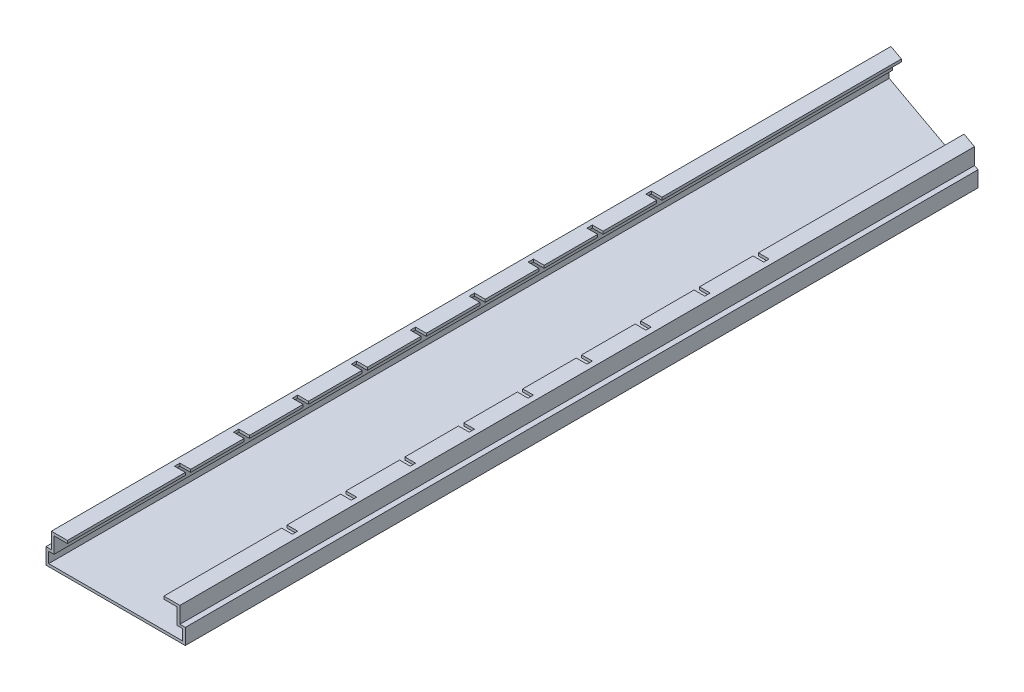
ISO-10303-21;
HEADER;
FILE_DESCRIPTION(('STEP AP214'),'2;1');
FILE_NAME('part.step','',(''),(''),'','','');
FILE_SCHEMA(('AUTOMOTIVE_DESIGN { 1 0 10303 214 1 1 1 1 }'));
ENDSEC;
DATA;
#1=APPLICATION_CONTEXT('core data for automotive mechanical design processes');
#2=APPLICATION_PROTOCOL_DEFINITION('international standard','automotive_design',2000,#1);
#3=PRODUCT_CONTEXT('',#1,'mechanical');
#4=PRODUCT('Part','Part','',(#3));
#5=PRODUCT_RELATED_PRODUCT_CATEGORY('part','',(#4));
#6=PRODUCT_DEFINITION_FORMATION('','',#4);
#7=PRODUCT_DEFINITION_CONTEXT('part definition',#1,'design');
#8=PRODUCT_DEFINITION('design','',#6,#7);
#9=PRODUCT_DEFINITION_SHAPE('','',#8);
#10=(LENGTH_UNIT() NAMED_UNIT(*) SI_UNIT(.MILLI.,.METRE.));
#11=(NAMED_UNIT(*) PLANE_ANGLE_UNIT() SI_UNIT($,.RADIAN.));
#12=(NAMED_UNIT(*) SI_UNIT($,.STERADIAN.) SOLID_ANGLE_UNIT());
#13=UNCERTAINTY_MEASURE_WITH_UNIT(LENGTH_MEASURE(1.E-05),#10,'distance_accuracy_value','');
#14=(GEOMETRIC_REPRESENTATION_CONTEXT(3) GLOBAL_UNCERTAINTY_ASSIGNED_CONTEXT((#13)) GLOBAL_UNIT_ASSIGNED_CONTEXT((#10,
#11,#12)) REPRESENTATION_CONTEXT('',''));
#15=CARTESIAN_POINT('',(0.,0.,0.));
#16=DIRECTION('',(0.,0.,1.));
#17=DIRECTION('',(1.,0.,0.));
#18=AXIS2_PLACEMENT_3D('',#15,#16,#17);
#19=CARTESIAN_POINT('',(9.,0.,-155.702992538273));
#20=DIRECTION('',(-1.,0.,0.));
#21=DIRECTION('',(0.,0.,1.));
#22=AXIS2_PLACEMENT_3D('',#19,#20,#21);
#23=PLANE('',#22);
#24=DIRECTION('',(0.,0.,1.));
#25=VECTOR('',#24,1.);
#26=CARTESIAN_POINT('',(9.,5.5,-155.702992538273));
#27=LINE('',#26,#25);
#28=CARTESIAN_POINT('',(9.,5.5,-33.));
#29=VERTEX_POINT('',#28);
#30=CARTESIAN_POINT('',(9.,5.5,-23.));
#31=VERTEX_POINT('',#30);
#32=EDGE_CURVE('E1322',#29,#31,#27,.T.);
#33=ORIENTED_EDGE('',*,*,#32,.T.);
#34=DIRECTION('',(0.,1.,0.));
#35=VECTOR('',#34,1.);
#36=CARTESIAN_POINT('',(9.,-0.00100000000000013,-23.));
#37=LINE('',#36,#35);
#38=CARTESIAN_POINT('',(9.,6.,-23.));
#39=VERTEX_POINT('',#38);
#40=EDGE_CURVE('E638',#31,#39,#37,.T.);
#41=ORIENTED_EDGE('',*,*,#40,.T.);
#42=DIRECTION('',(0.,0.,1.));
#43=VECTOR('',#42,1.);
#44=CARTESIAN_POINT('',(9.,6.,-155.702992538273));
#45=LINE('',#44,#43);
#46=CARTESIAN_POINT('',(9.,6.,-33.));
#47=VERTEX_POINT('',#46);
#48=EDGE_CURVE('E1393',#47,#39,#45,.T.);
#49=ORIENTED_EDGE('',*,*,#48,.F.);
#50=DIRECTION('',(0.,1.,0.));
#51=VECTOR('',#50,1.);
#52=CARTESIAN_POINT('',(9.,-0.00100000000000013,-33.));
#53=LINE('',#52,#51);
#54=EDGE_CURVE('E663',#29,#47,#53,.T.);
#55=ORIENTED_EDGE('',*,*,#54,.F.);
#56=EDGE_LOOP('',(#33,#41,#49,#55));
#57=FACE_BOUND('',#56,.T.);
#58=ADVANCED_FACE('F38',(#57),#23,.T.);
#59=CARTESIAN_POINT('',(0.,5.5,-155.702992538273));
#60=DIRECTION('',(0.,-1.,0.));
#61=DIRECTION('',(0.,0.,-1.));
#62=AXIS2_PLACEMENT_3D('',#59,#60,#61);
#63=PLANE('',#62);
#64=DIRECTION('',(1.,0.,0.));
#65=VECTOR('',#64,1.);
#66=CARTESIAN_POINT('',(0.,5.5,-22.));
#67=LINE('',#66,#65);
#68=CARTESIAN_POINT('',(9.,5.5,-22.));
#69=VERTEX_POINT('',#68);
#70=CARTESIAN_POINT('',(11.,5.5,-22.));
#71=VERTEX_POINT('',#70);
#72=EDGE_CURVE('E623',#69,#71,#67,.T.);
#73=ORIENTED_EDGE('',*,*,#72,.T.);
#74=DIRECTION('',(0.,0.,-1.));
#75=VECTOR('',#74,1.);
#76=CARTESIAN_POINT('',(11.,5.5,0.));
#77=LINE('',#76,#75);
#78=CARTESIAN_POINT('',(11.,5.5,-23.));
#79=VERTEX_POINT('',#78);
#80=EDGE_CURVE('E610',#71,#79,#77,.T.);
#81=ORIENTED_EDGE('',*,*,#80,.T.);
#82=DIRECTION('',(1.,0.,0.));
#83=VECTOR('',#82,1.);
#84=CARTESIAN_POINT('',(0.,5.5,-23.));
#85=LINE('',#84,#83);
#86=EDGE_CURVE('E641',#31,#79,#85,.T.);
#87=ORIENTED_EDGE('',*,*,#86,.F.);
#88=ORIENTED_EDGE('',*,*,#32,.F.);
#89=DIRECTION('',(1.,0.,0.));
#90=VECTOR('',#89,1.);
#91=CARTESIAN_POINT('',(0.,5.5,-33.));
#92=LINE('',#91,#90);
#93=CARTESIAN_POINT('',(11.,5.5,-33.));
#94=VERTEX_POINT('',#93);
#95=EDGE_CURVE('E64',#29,#94,#92,.T.);
#96=ORIENTED_EDGE('',*,*,#95,.T.);
#97=DIRECTION('',(0.,0.,-1.));
#98=VECTOR('',#97,1.);
#99=CARTESIAN_POINT('',(11.,5.5,0.));
#100=LINE('',#99,#98);
#101=CARTESIAN_POINT('',(11.,5.5,-34.));
#102=VERTEX_POINT('',#101);
#103=EDGE_CURVE('E642',#94,#102,#100,.T.);
#104=ORIENTED_EDGE('',*,*,#103,.T.);
#105=DIRECTION('',(1.,0.,0.));
#106=VECTOR('',#105,1.);
#107=CARTESIAN_POINT('',(0.,5.5,-34.));
#108=LINE('',#107,#106);
#109=CARTESIAN_POINT('',(9.,5.5,-34.));
#110=VERTEX_POINT('',#109);
#111=EDGE_CURVE('E662',#110,#102,#108,.T.);
#112=ORIENTED_EDGE('',*,*,#111,.F.);
#113=CARTESIAN_POINT('',(9.,5.5,-44.));
#114=VERTEX_POINT('',#113);
#115=EDGE_CURVE('E1326',#114,#110,#27,.T.);
#116=ORIENTED_EDGE('',*,*,#115,.F.);
#117=DIRECTION('',(1.,0.,0.));
#118=VECTOR('',#117,1.);
#119=CARTESIAN_POINT('',(0.,5.5,-44.));
#120=LINE('',#119,#118);
#121=CARTESIAN_POINT('',(11.,5.5,-44.));
#122=VERTEX_POINT('',#121);
#123=EDGE_CURVE('E674',#114,#122,#120,.T.);
#124=ORIENTED_EDGE('',*,*,#123,.T.);
#125=DIRECTION('',(0.,0.,-1.));
#126=VECTOR('',#125,1.);
#127=CARTESIAN_POINT('',(11.,5.5,0.));
#128=LINE('',#127,#126);
#129=CARTESIAN_POINT('',(11.,5.5,-45.));
#130=VERTEX_POINT('',#129);
#131=EDGE_CURVE('E671',#122,#130,#128,.T.);
#132=ORIENTED_EDGE('',*,*,#131,.T.);
#133=DIRECTION('',(1.,0.,0.));
#134=VECTOR('',#133,1.);
#135=CARTESIAN_POINT('',(0.,5.5,-45.));
#136=LINE('',#135,#134);
#137=CARTESIAN_POINT('',(9.,5.5,-45.));
#138=VERTEX_POINT('',#137);
#139=EDGE_CURVE('E689',#138,#130,#136,.T.);
#140=ORIENTED_EDGE('',*,*,#139,.F.);
#141=CARTESIAN_POINT('',(9.,5.5,-55.));
#142=VERTEX_POINT('',#141);
#143=EDGE_CURVE('E1330',#142,#138,#27,.T.);
#144=ORIENTED_EDGE('',*,*,#143,.F.);
#145=DIRECTION('',(1.,0.,0.));
#146=VECTOR('',#145,1.);
#147=CARTESIAN_POINT('',(0.,5.5,-55.));
#148=LINE('',#147,#146);
#149=CARTESIAN_POINT('',(11.,5.5,-55.));
#150=VERTEX_POINT('',#149);
#151=EDGE_CURVE('E715',#142,#150,#148,.T.);
#152=ORIENTED_EDGE('',*,*,#151,.T.);
#153=DIRECTION('',(0.,0.,1.));
#154=VECTOR('',#153,1.);
#155=CARTESIAN_POINT('',(11.,5.5,0.));
#156=LINE('',#155,#154);
#157=CARTESIAN_POINT('',(11.,5.5,-56.));
#158=VERTEX_POINT('',#157);
#159=EDGE_CURVE('E712',#158,#150,#156,.T.);
#160=ORIENTED_EDGE('',*,*,#159,.F.);
#161=DIRECTION('',(1.,0.,0.));
#162=VECTOR('',#161,1.);
#163=CARTESIAN_POINT('',(0.,5.5,-56.));
#164=LINE('',#163,#162);
#165=CARTESIAN_POINT('',(9.,5.5,-56.));
#166=VERTEX_POINT('',#165);
#167=EDGE_CURVE('E710',#166,#158,#164,.T.);
#168=ORIENTED_EDGE('',*,*,#167,.F.);
#169=CARTESIAN_POINT('',(9.,5.5,-66.));
#170=VERTEX_POINT('',#169);
#171=EDGE_CURVE('E1335',#170,#166,#27,.T.);
#172=ORIENTED_EDGE('',*,*,#171,.F.);
#173=DIRECTION('',(-1.,0.,0.));
#174=VECTOR('',#173,1.);
#175=CARTESIAN_POINT('',(0.,5.5,-66.));
#176=LINE('',#175,#174);
#177=CARTESIAN_POINT('',(11.,5.5,-66.));
#178=VERTEX_POINT('',#177);
#179=EDGE_CURVE('E736',#178,#170,#176,.T.);
#180=ORIENTED_EDGE('',*,*,#179,.F.);
#181=DIRECTION('',(0.,0.,-1.));
#182=VECTOR('',#181,1.);
#183=CARTESIAN_POINT('',(11.,5.5,0.));
#184=LINE('',#183,#182);
#185=CARTESIAN_POINT('',(11.,5.5,-67.));
#186=VERTEX_POINT('',#185);
#187=EDGE_CURVE('E725',#178,#186,#184,.T.);
#188=ORIENTED_EDGE('',*,*,#187,.T.);
#189=DIRECTION('',(-1.,0.,0.));
#190=VECTOR('',#189,1.);
#191=CARTESIAN_POINT('',(0.,5.5,-67.));
#192=LINE('',#191,#190);
#193=CARTESIAN_POINT('',(9.,5.5,-67.));
#194=VERTEX_POINT('',#193);
#195=EDGE_CURVE('E740',#186,#194,#192,.T.);
#196=ORIENTED_EDGE('',*,*,#195,.T.);
#197=CARTESIAN_POINT('',(9.,5.5,-77.));
#198=VERTEX_POINT('',#197);
#199=EDGE_CURVE('E1340',#198,#194,#27,.T.);
#200=ORIENTED_EDGE('',*,*,#199,.F.);
#201=DIRECTION('',(1.,0.,0.));
#202=VECTOR('',#201,1.);
#203=CARTESIAN_POINT('',(0.,5.5,-77.));
#204=LINE('',#203,#202);
#205=CARTESIAN_POINT('',(11.,5.5,-77.));
#206=VERTEX_POINT('',#205);
#207=EDGE_CURVE('E766',#198,#206,#204,.T.);
#208=ORIENTED_EDGE('',*,*,#207,.T.);
#209=DIRECTION('',(0.,0.,1.));
#210=VECTOR('',#209,1.);
#211=CARTESIAN_POINT('',(10.9999999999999,5.5,0.));
#212=LINE('',#211,#210);
#213=CARTESIAN_POINT('',(11.,5.5,-78.));
#214=VERTEX_POINT('',#213);
#215=EDGE_CURVE('E763',#214,#206,#212,.T.);
#216=ORIENTED_EDGE('',*,*,#215,.F.);
#217=DIRECTION('',(1.,0.,0.));
#218=VECTOR('',#217,1.);
#219=CARTESIAN_POINT('',(0.,5.5,-78.));
#220=LINE('',#219,#218);
#221=CARTESIAN_POINT('',(9.,5.5,-78.));
#222=VERTEX_POINT('',#221);
#223=EDGE_CURVE('E761',#222,#214,#220,.T.);
#224=ORIENTED_EDGE('',*,*,#223,.F.);
#225=CARTESIAN_POINT('',(9.,5.5,-88.));
#226=VERTEX_POINT('',#225);
#227=EDGE_CURVE('E1345',#226,#222,#27,.T.);
#228=ORIENTED_EDGE('',*,*,#227,.F.);
#229=DIRECTION('',(1.,0.,0.));
#230=VECTOR('',#229,1.);
#231=CARTESIAN_POINT('',(0.,5.5,-88.));
#232=LINE('',#231,#230);
#233=CARTESIAN_POINT('',(11.,5.5,-88.));
#234=VERTEX_POINT('',#233);
#235=EDGE_CURVE('E791',#226,#234,#232,.T.);
#236=ORIENTED_EDGE('',*,*,#235,.T.);
#237=DIRECTION('',(0.,0.,1.));
#238=VECTOR('',#237,1.);
#239=CARTESIAN_POINT('',(10.9999999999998,5.5,0.));
#240=LINE('',#239,#238);
#241=CARTESIAN_POINT('',(11.,5.5,-89.));
#242=VERTEX_POINT('',#241);
#243=EDGE_CURVE('E788',#242,#234,#240,.T.);
#244=ORIENTED_EDGE('',*,*,#243,.F.);
#245=DIRECTION('',(1.,0.,0.));
#246=VECTOR('',#245,1.);
#247=CARTESIAN_POINT('',(0.,5.5,-89.));
#248=LINE('',#247,#246);
#249=CARTESIAN_POINT('',(9.,5.5,-89.));
#250=VERTEX_POINT('',#249);
#251=EDGE_CURVE('E786',#250,#242,#248,.T.);
#252=ORIENTED_EDGE('',*,*,#251,.F.);
#253=CARTESIAN_POINT('',(9.,5.5,-99.));
#254=VERTEX_POINT('',#253);
#255=EDGE_CURVE('E1321',#254,#250,#27,.T.);
#256=ORIENTED_EDGE('',*,*,#255,.F.);
#257=DIRECTION('',(1.,0.,0.));
#258=VECTOR('',#257,1.);
#259=CARTESIAN_POINT('',(0.,5.5,-99.));
#260=LINE('',#259,#258);
#261=CARTESIAN_POINT('',(11.,5.5,-99.));
#262=VERTEX_POINT('',#261);
#263=EDGE_CURVE('E816',#254,#262,#260,.T.);
#264=ORIENTED_EDGE('',*,*,#263,.T.);
#265=DIRECTION('',(0.,0.,1.));
#266=VECTOR('',#265,1.);
#267=CARTESIAN_POINT('',(11.,5.5,0.));
#268=LINE('',#267,#266);
#269=CARTESIAN_POINT('',(11.,5.5,-100.));
#270=VERTEX_POINT('',#269);
#271=EDGE_CURVE('E813',#270,#262,#268,.T.);
#272=ORIENTED_EDGE('',*,*,#271,.F.);
#273=DIRECTION('',(1.,0.,0.));
#274=VECTOR('',#273,1.);
#275=CARTESIAN_POINT('',(0.,5.5,-100.));
#276=LINE('',#275,#274);
#277=CARTESIAN_POINT('',(9.,5.5,-100.));
#278=VERTEX_POINT('',#277);
#279=EDGE_CURVE('E811',#278,#270,#276,.T.);
#280=ORIENTED_EDGE('',*,*,#279,.F.);
#281=CARTESIAN_POINT('',(9.,5.5,-110.));
#282=VERTEX_POINT('',#281);
#283=EDGE_CURVE('E1319',#282,#278,#27,.T.);
#284=ORIENTED_EDGE('',*,*,#283,.F.);
#285=DIRECTION('',(1.,0.,0.));
#286=VECTOR('',#285,1.);
#287=CARTESIAN_POINT('',(0.,5.5,-110.));
#288=LINE('',#287,#286);
#289=CARTESIAN_POINT('',(11.,5.5,-110.));
#290=VERTEX_POINT('',#289);
#291=EDGE_CURVE('E841',#282,#290,#288,.T.);
#292=ORIENTED_EDGE('',*,*,#291,.T.);
#293=DIRECTION('',(0.,0.,1.));
#294=VECTOR('',#293,1.);
#295=CARTESIAN_POINT('',(11.0000000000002,5.5,0.));
#296=LINE('',#295,#294);
#297=CARTESIAN_POINT('',(11.,5.5,-111.));
#298=VERTEX_POINT('',#297);
#299=EDGE_CURVE('E838',#298,#290,#296,.T.);
#300=ORIENTED_EDGE('',*,*,#299,.F.);
#301=DIRECTION('',(1.,0.,0.));
#302=VECTOR('',#301,1.);
#303=CARTESIAN_POINT('',(0.,5.5,-111.));
#304=LINE('',#303,#302);
#305=CARTESIAN_POINT('',(9.,5.5,-111.));
#306=VERTEX_POINT('',#305);
#307=EDGE_CURVE('E836',#306,#298,#304,.T.);
#308=ORIENTED_EDGE('',*,*,#307,.F.);
#309=CARTESIAN_POINT('',(9.,5.5,-149.4));
#310=VERTEX_POINT('',#309);
#311=EDGE_CURVE('E1233',#310,#306,#27,.T.);
#312=ORIENTED_EDGE('',*,*,#311,.F.);
#313=DIRECTION('',(0.943858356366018,0.,0.330350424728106));
#314=VECTOR('',#313,1.);
#315=CARTESIAN_POINT('',(-0.983115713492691,5.5,-152.894090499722));
#316=LINE('',#315,#314);
#317=CARTESIAN_POINT('',(11.5,5.5,-148.525));
#318=VERTEX_POINT('',#317);
#319=EDGE_CURVE('E1179',#310,#318,#316,.T.);
#320=ORIENTED_EDGE('',*,*,#319,.T.);
#321=DIRECTION('',(0.,0.,1.));
#322=VECTOR('',#321,1.);
#323=CARTESIAN_POINT('',(11.5,5.5,-155.702992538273));
#324=LINE('',#323,#322);
#325=CARTESIAN_POINT('',(11.5,5.5,0.));
#326=VERTEX_POINT('',#325);
#327=EDGE_CURVE('E1182',#318,#326,#324,.T.);
#328=ORIENTED_EDGE('',*,*,#327,.T.);
#329=DIRECTION('',(1.,0.,0.));
#330=VECTOR('',#329,1.);
#331=CARTESIAN_POINT('',(0.,5.5,0.));
#332=LINE('',#331,#330);
#333=CARTESIAN_POINT('',(9.,5.5,0.));
#334=VERTEX_POINT('',#333);
#335=EDGE_CURVE('E1172',#334,#326,#332,.T.);
#336=ORIENTED_EDGE('',*,*,#335,.F.);
#337=EDGE_CURVE('E632',#69,#334,#27,.T.);
#338=ORIENTED_EDGE('',*,*,#337,.F.);
#339=EDGE_LOOP('',(#73,#81,#87,#88,#96,#104,#112,#116,#124,#132,#140,#144,#152,#160,#168,#172,
#180,#188,#196,#200,#208,#216,#224,#228,#236,#244,#252,#256,#264,#272,#280,#284,#292,#300,#308,
#312,#320,#328,#336,#338));
#340=FACE_BOUND('',#339,.T.);
#341=ADVANCED_FACE('F630',(#340),#63,.T.);
#342=CARTESIAN_POINT('',(0.,6.,-155.702992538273));
#343=DIRECTION('',(0.,-1.,0.));
#344=DIRECTION('',(0.,0.,-1.));
#345=AXIS2_PLACEMENT_3D('',#342,#343,#344);
#346=PLANE('',#345);
#347=DIRECTION('',(0.,0.,-1.));
#348=VECTOR('',#347,1.);
#349=CARTESIAN_POINT('',(11.,6.,0.));
#350=LINE('',#349,#348);
#351=CARTESIAN_POINT('',(11.,6.,-22.));
#352=VERTEX_POINT('',#351);
#353=CARTESIAN_POINT('',(11.,6.,-23.));
#354=VERTEX_POINT('',#353);
#355=EDGE_CURVE('E633',#352,#354,#350,.T.);
#356=ORIENTED_EDGE('',*,*,#355,.F.);
#357=DIRECTION('',(1.,0.,0.));
#358=VECTOR('',#357,1.);
#359=CARTESIAN_POINT('',(0.,6.,-22.));
#360=LINE('',#359,#358);
#361=CARTESIAN_POINT('',(9.,6.,-22.));
#362=VERTEX_POINT('',#361);
#363=EDGE_CURVE('E626',#362,#352,#360,.T.);
#364=ORIENTED_EDGE('',*,*,#363,.F.);
#365=CARTESIAN_POINT('',(9.,6.,0.));
#366=VERTEX_POINT('',#365);
#367=EDGE_CURVE('E1159',#362,#366,#45,.T.);
#368=ORIENTED_EDGE('',*,*,#367,.T.);
#369=DIRECTION('',(1.,0.,0.));
#370=VECTOR('',#369,1.);
#371=CARTESIAN_POINT('',(0.,6.,0.));
#372=LINE('',#371,#370);
#373=CARTESIAN_POINT('',(12.,6.,0.));
#374=VERTEX_POINT('',#373);
#375=EDGE_CURVE('E1151',#366,#374,#372,.T.);
#376=ORIENTED_EDGE('',*,*,#375,.T.);
#377=DIRECTION('',(0.,0.,1.));
#378=VECTOR('',#377,1.);
#379=CARTESIAN_POINT('',(12.,6.,-155.702992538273));
#380=LINE('',#379,#378);
#381=CARTESIAN_POINT('',(12.,6.,-148.35));
#382=VERTEX_POINT('',#381);
#383=EDGE_CURVE('E1160',#382,#374,#380,.T.);
#384=ORIENTED_EDGE('',*,*,#383,.F.);
#385=DIRECTION('',(0.943858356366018,0.,0.330350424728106));
#386=VECTOR('',#385,1.);
#387=CARTESIAN_POINT('',(-0.983115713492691,6.,-152.894090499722));
#388=LINE('',#387,#386);
#389=CARTESIAN_POINT('',(9.,6.,-149.4));
#390=VERTEX_POINT('',#389);
#391=EDGE_CURVE('E1115',#390,#382,#388,.T.);
#392=ORIENTED_EDGE('',*,*,#391,.F.);
#393=CARTESIAN_POINT('',(9.,6.,-111.));
#394=VERTEX_POINT('',#393);
#395=EDGE_CURVE('E1155',#390,#394,#45,.T.);
#396=ORIENTED_EDGE('',*,*,#395,.T.);
#397=DIRECTION('',(1.,0.,0.));
#398=VECTOR('',#397,1.);
#399=CARTESIAN_POINT('',(0.,6.,-111.));
#400=LINE('',#399,#398);
#401=CARTESIAN_POINT('',(11.,6.,-111.));
#402=VERTEX_POINT('',#401);
#403=EDGE_CURVE('E833',#394,#402,#400,.T.);
#404=ORIENTED_EDGE('',*,*,#403,.T.);
#405=DIRECTION('',(0.,0.,1.));
#406=VECTOR('',#405,1.);
#407=CARTESIAN_POINT('',(11.0000000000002,6.,0.));
#408=LINE('',#407,#406);
#409=CARTESIAN_POINT('',(11.,6.,-110.));
#410=VERTEX_POINT('',#409);
#411=EDGE_CURVE('E825',#402,#410,#408,.T.);
#412=ORIENTED_EDGE('',*,*,#411,.T.);
#413=DIRECTION('',(1.,0.,0.));
#414=VECTOR('',#413,1.);
#415=CARTESIAN_POINT('',(0.,6.,-110.));
#416=LINE('',#415,#414);
#417=CARTESIAN_POINT('',(9.,6.,-110.));
#418=VERTEX_POINT('',#417);
#419=EDGE_CURVE('E815',#418,#410,#416,.T.);
#420=ORIENTED_EDGE('',*,*,#419,.F.);
#421=CARTESIAN_POINT('',(9.,6.,-100.));
#422=VERTEX_POINT('',#421);
#423=EDGE_CURVE('E1200',#418,#422,#45,.T.);
#424=ORIENTED_EDGE('',*,*,#423,.T.);
#425=DIRECTION('',(1.,0.,0.));
#426=VECTOR('',#425,1.);
#427=CARTESIAN_POINT('',(0.,6.,-100.));
#428=LINE('',#427,#426);
#429=CARTESIAN_POINT('',(11.,6.,-100.));
#430=VERTEX_POINT('',#429);
#431=EDGE_CURVE('E808',#422,#430,#428,.T.);
#432=ORIENTED_EDGE('',*,*,#431,.T.);
#433=DIRECTION('',(0.,0.,1.));
#434=VECTOR('',#433,1.);
#435=CARTESIAN_POINT('',(11.,6.,0.));
#436=LINE('',#435,#434);
#437=CARTESIAN_POINT('',(11.,6.,-99.));
#438=VERTEX_POINT('',#437);
#439=EDGE_CURVE('E800',#430,#438,#436,.T.);
#440=ORIENTED_EDGE('',*,*,#439,.T.);
#441=DIRECTION('',(1.,0.,0.));
#442=VECTOR('',#441,1.);
#443=CARTESIAN_POINT('',(0.,6.,-99.));
#444=LINE('',#443,#442);
#445=CARTESIAN_POINT('',(9.,6.,-99.));
#446=VERTEX_POINT('',#445);
#447=EDGE_CURVE('E790',#446,#438,#444,.T.);
#448=ORIENTED_EDGE('',*,*,#447,.F.);
#449=CARTESIAN_POINT('',(9.,6.,-89.));
#450=VERTEX_POINT('',#449);
#451=EDGE_CURVE('E1374',#446,#450,#45,.T.);
#452=ORIENTED_EDGE('',*,*,#451,.T.);
#453=DIRECTION('',(1.,0.,0.));
#454=VECTOR('',#453,1.);
#455=CARTESIAN_POINT('',(0.,6.,-89.));
#456=LINE('',#455,#454);
#457=CARTESIAN_POINT('',(11.,6.,-89.));
#458=VERTEX_POINT('',#457);
#459=EDGE_CURVE('E783',#450,#458,#456,.T.);
#460=ORIENTED_EDGE('',*,*,#459,.T.);
#461=DIRECTION('',(0.,0.,1.));
#462=VECTOR('',#461,1.);
#463=CARTESIAN_POINT('',(10.9999999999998,6.,0.));
#464=LINE('',#463,#462);
#465=CARTESIAN_POINT('',(11.,6.,-88.));
#466=VERTEX_POINT('',#465);
#467=EDGE_CURVE('E775',#458,#466,#464,.T.);
#468=ORIENTED_EDGE('',*,*,#467,.T.);
#469=DIRECTION('',(1.,0.,0.));
#470=VECTOR('',#469,1.);
#471=CARTESIAN_POINT('',(0.,6.,-88.));
#472=LINE('',#471,#470);
#473=CARTESIAN_POINT('',(9.,6.,-88.));
#474=VERTEX_POINT('',#473);
#475=EDGE_CURVE('E765',#474,#466,#472,.T.);
#476=ORIENTED_EDGE('',*,*,#475,.F.);
#477=CARTESIAN_POINT('',(9.,6.,-78.));
#478=VERTEX_POINT('',#477);
#479=EDGE_CURVE('E1375',#474,#478,#45,.T.);
#480=ORIENTED_EDGE('',*,*,#479,.T.);
#481=DIRECTION('',(1.,0.,0.));
#482=VECTOR('',#481,1.);
#483=CARTESIAN_POINT('',(0.,6.,-78.));
#484=LINE('',#483,#482);
#485=CARTESIAN_POINT('',(11.,6.,-78.));
#486=VERTEX_POINT('',#485);
#487=EDGE_CURVE('E758',#478,#486,#484,.T.);
#488=ORIENTED_EDGE('',*,*,#487,.T.);
#489=DIRECTION('',(0.,0.,1.));
#490=VECTOR('',#489,1.);
#491=CARTESIAN_POINT('',(10.9999999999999,6.,0.));
#492=LINE('',#491,#490);
#493=CARTESIAN_POINT('',(11.,6.,-77.));
#494=VERTEX_POINT('',#493);
#495=EDGE_CURVE('E750',#486,#494,#492,.T.);
#496=ORIENTED_EDGE('',*,*,#495,.T.);
#497=DIRECTION('',(1.,0.,0.));
#498=VECTOR('',#497,1.);
#499=CARTESIAN_POINT('',(0.,6.,-77.));
#500=LINE('',#499,#498);
#501=CARTESIAN_POINT('',(9.,6.,-77.));
#502=VERTEX_POINT('',#501);
#503=EDGE_CURVE('E739',#502,#494,#500,.T.);
#504=ORIENTED_EDGE('',*,*,#503,.F.);
#505=CARTESIAN_POINT('',(9.,6.,-67.));
#506=VERTEX_POINT('',#505);
#507=EDGE_CURVE('E1378',#502,#506,#45,.T.);
#508=ORIENTED_EDGE('',*,*,#507,.T.);
#509=DIRECTION('',(-1.,0.,0.));
#510=VECTOR('',#509,1.);
#511=CARTESIAN_POINT('',(0.,6.,-67.));
#512=LINE('',#511,#510);
#513=CARTESIAN_POINT('',(11.,6.,-67.));
#514=VERTEX_POINT('',#513);
#515=EDGE_CURVE('E729',#514,#506,#512,.T.);
#516=ORIENTED_EDGE('',*,*,#515,.F.);
#517=DIRECTION('',(0.,0.,-1.));
#518=VECTOR('',#517,1.);
#519=CARTESIAN_POINT('',(11.,6.,0.));
#520=LINE('',#519,#518);
#521=CARTESIAN_POINT('',(11.,6.,-66.));
#522=VERTEX_POINT('',#521);
#523=EDGE_CURVE('E714',#522,#514,#520,.T.);
#524=ORIENTED_EDGE('',*,*,#523,.F.);
#525=DIRECTION('',(-1.,0.,0.));
#526=VECTOR('',#525,1.);
#527=CARTESIAN_POINT('',(0.,6.,-66.));
#528=LINE('',#527,#526);
#529=CARTESIAN_POINT('',(9.,6.,-66.));
#530=VERTEX_POINT('',#529);
#531=EDGE_CURVE('E733',#522,#530,#528,.T.);
#532=ORIENTED_EDGE('',*,*,#531,.T.);
#533=CARTESIAN_POINT('',(9.,6.,-56.));
#534=VERTEX_POINT('',#533);
#535=EDGE_CURVE('E1381',#530,#534,#45,.T.);
#536=ORIENTED_EDGE('',*,*,#535,.T.);
#537=DIRECTION('',(1.,0.,0.));
#538=VECTOR('',#537,1.);
#539=CARTESIAN_POINT('',(0.,6.,-56.));
#540=LINE('',#539,#538);
#541=CARTESIAN_POINT('',(11.,6.,-56.));
#542=VERTEX_POINT('',#541);
#543=EDGE_CURVE('E707',#534,#542,#540,.T.);
#544=ORIENTED_EDGE('',*,*,#543,.T.);
#545=DIRECTION('',(0.,0.,1.));
#546=VECTOR('',#545,1.);
#547=CARTESIAN_POINT('',(11.,6.,0.));
#548=LINE('',#547,#546);
#549=CARTESIAN_POINT('',(11.,6.,-55.));
#550=VERTEX_POINT('',#549);
#551=EDGE_CURVE('E699',#542,#550,#548,.T.);
#552=ORIENTED_EDGE('',*,*,#551,.T.);
#553=DIRECTION('',(1.,0.,0.));
#554=VECTOR('',#553,1.);
#555=CARTESIAN_POINT('',(0.,6.,-55.));
#556=LINE('',#555,#554);
#557=CARTESIAN_POINT('',(9.,6.,-55.));
#558=VERTEX_POINT('',#557);
#559=EDGE_CURVE('E698',#558,#550,#556,.T.);
#560=ORIENTED_EDGE('',*,*,#559,.F.);
#561=CARTESIAN_POINT('',(9.,6.,-45.));
#562=VERTEX_POINT('',#561);
#563=EDGE_CURVE('E1386',#558,#562,#45,.T.);
#564=ORIENTED_EDGE('',*,*,#563,.T.);
#565=DIRECTION('',(1.,0.,0.));
#566=VECTOR('',#565,1.);
#567=CARTESIAN_POINT('',(0.,6.,-45.));
#568=LINE('',#567,#566);
#569=CARTESIAN_POINT('',(11.,6.,-45.));
#570=VERTEX_POINT('',#569);
#571=EDGE_CURVE('E680',#562,#570,#568,.T.);
#572=ORIENTED_EDGE('',*,*,#571,.T.);
#573=DIRECTION('',(0.,0.,-1.));
#574=VECTOR('',#573,1.);
#575=CARTESIAN_POINT('',(11.,6.,0.));
#576=LINE('',#575,#574);
#577=CARTESIAN_POINT('',(11.,6.,-44.));
#578=VERTEX_POINT('',#577);
#579=EDGE_CURVE('E677',#578,#570,#576,.T.);
#580=ORIENTED_EDGE('',*,*,#579,.F.);
#581=DIRECTION('',(1.,0.,0.));
#582=VECTOR('',#581,1.);
#583=CARTESIAN_POINT('',(0.,6.,-44.));
#584=LINE('',#583,#582);
#585=CARTESIAN_POINT('',(9.,6.,-44.));
#586=VERTEX_POINT('',#585);
#587=EDGE_CURVE('E683',#586,#578,#584,.T.);
#588=ORIENTED_EDGE('',*,*,#587,.F.);
#589=CARTESIAN_POINT('',(9.,6.,-34.));
#590=VERTEX_POINT('',#589);
#591=EDGE_CURVE('E1389',#586,#590,#45,.T.);
#592=ORIENTED_EDGE('',*,*,#591,.T.);
#593=DIRECTION('',(1.,0.,0.));
#594=VECTOR('',#593,1.);
#595=CARTESIAN_POINT('',(0.,6.,-34.));
#596=LINE('',#595,#594);
#597=CARTESIAN_POINT('',(11.,6.,-34.));
#598=VERTEX_POINT('',#597);
#599=EDGE_CURVE('E653',#590,#598,#596,.T.);
#600=ORIENTED_EDGE('',*,*,#599,.T.);
#601=DIRECTION('',(0.,0.,-1.));
#602=VECTOR('',#601,1.);
#603=CARTESIAN_POINT('',(11.,6.,0.));
#604=LINE('',#603,#602);
#605=CARTESIAN_POINT('',(11.,6.,-33.));
#606=VERTEX_POINT('',#605);
#607=EDGE_CURVE('E650',#606,#598,#604,.T.);
#608=ORIENTED_EDGE('',*,*,#607,.F.);
#609=DIRECTION('',(1.,0.,0.));
#610=VECTOR('',#609,1.);
#611=CARTESIAN_POINT('',(0.,6.,-33.));
#612=LINE('',#611,#610);
#613=EDGE_CURVE('E656',#47,#606,#612,.T.);
#614=ORIENTED_EDGE('',*,*,#613,.F.);
#615=ORIENTED_EDGE('',*,*,#48,.T.);
#616=DIRECTION('',(1.,0.,0.));
#617=VECTOR('',#616,1.);
#618=CARTESIAN_POINT('',(0.,6.,-23.));
#619=LINE('',#618,#617);
#620=EDGE_CURVE('E56',#39,#354,#619,.T.);
#621=ORIENTED_EDGE('',*,*,#620,.T.);
#622=EDGE_LOOP('',(#356,#364,#368,#376,#384,#392,#396,#404,#412,#420,#424,#432,#440,#448,#452,
#460,#468,#476,#480,#488,#496,#504,#508,#516,#524,#532,#536,#544,#552,#560,#564,#572,#580,#588,
#592,#600,#608,#614,#615,#621));
#623=FACE_BOUND('',#622,.T.);
#624=ADVANCED_FACE('F1372',(#623),#346,.F.);
#625=ORIENTED_EDGE('',*,*,#115,.T.);
#626=DIRECTION('',(0.,1.,0.));
#627=VECTOR('',#626,1.);
#628=CARTESIAN_POINT('',(9.,-0.00100000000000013,-34.));
#629=LINE('',#628,#627);
#630=EDGE_CURVE('E665',#110,#590,#629,.T.);
#631=ORIENTED_EDGE('',*,*,#630,.T.);
#632=ORIENTED_EDGE('',*,*,#591,.F.);
#633=DIRECTION('',(0.,1.,0.));
#634=VECTOR('',#633,1.);
#635=CARTESIAN_POINT('',(9.,-0.00100000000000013,-44.));
#636=LINE('',#635,#634);
#637=EDGE_CURVE('E690',#114,#586,#636,.T.);
#638=ORIENTED_EDGE('',*,*,#637,.F.);
#639=EDGE_LOOP('',(#625,#631,#632,#638));
#640=FACE_BOUND('',#639,.T.);
#641=ADVANCED_FACE('F1419',(#640),#23,.T.);
#642=ORIENTED_EDGE('',*,*,#143,.T.);
#643=DIRECTION('',(0.,1.,0.));
#644=VECTOR('',#643,1.);
#645=CARTESIAN_POINT('',(9.,-0.00100000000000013,-45.));
#646=LINE('',#645,#644);
#647=EDGE_CURVE('E692',#138,#562,#646,.T.);
#648=ORIENTED_EDGE('',*,*,#647,.T.);
#649=ORIENTED_EDGE('',*,*,#563,.F.);
#650=DIRECTION('',(0.,1.,0.));
#651=VECTOR('',#650,1.);
#652=CARTESIAN_POINT('',(9.,-0.00100000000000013,-55.));
#653=LINE('',#652,#651);
#654=EDGE_CURVE('E706',#142,#558,#653,.T.);
#655=ORIENTED_EDGE('',*,*,#654,.F.);
#656=EDGE_LOOP('',(#642,#648,#649,#655));
#657=FACE_BOUND('',#656,.T.);
#658=ADVANCED_FACE('F1414',(#657),#23,.T.);
#659=ORIENTED_EDGE('',*,*,#171,.T.);
#660=DIRECTION('',(0.,1.,0.));
#661=VECTOR('',#660,1.);
#662=CARTESIAN_POINT('',(9.,-0.00100000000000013,-56.));
#663=LINE('',#662,#661);
#664=EDGE_CURVE('E702',#166,#534,#663,.T.);
#665=ORIENTED_EDGE('',*,*,#664,.T.);
#666=ORIENTED_EDGE('',*,*,#535,.F.);
#667=DIRECTION('',(0.,1.,0.));
#668=VECTOR('',#667,1.);
#669=CARTESIAN_POINT('',(9.,-0.00100000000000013,-66.));
#670=LINE('',#669,#668);
#671=EDGE_CURVE('E744',#170,#530,#670,.T.);
#672=ORIENTED_EDGE('',*,*,#671,.F.);
#673=EDGE_LOOP('',(#659,#665,#666,#672));
#674=FACE_BOUND('',#673,.T.);
#675=ADVANCED_FACE('F1408',(#674),#23,.T.);
#676=DIRECTION('',(0.,1.,0.));
#677=VECTOR('',#676,1.);
#678=CARTESIAN_POINT('',(9.,-0.00100000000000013,-22.));
#679=LINE('',#678,#677);
#680=EDGE_CURVE('E637',#69,#362,#679,.T.);
#681=ORIENTED_EDGE('',*,*,#680,.F.);
#682=ORIENTED_EDGE('',*,*,#337,.T.);
#683=DIRECTION('',(0.,-1.,0.));
#684=VECTOR('',#683,1.);
#685=CARTESIAN_POINT('',(9.,0.,0.));
#686=LINE('',#685,#684);
#687=EDGE_CURVE('E1175',#366,#334,#686,.T.);
#688=ORIENTED_EDGE('',*,*,#687,.F.);
#689=ORIENTED_EDGE('',*,*,#367,.F.);
#690=EDGE_LOOP('',(#681,#682,#688,#689));
#691=FACE_BOUND('',#690,.T.);
#692=ADVANCED_FACE('F1405',(#691),#23,.T.);
#693=ORIENTED_EDGE('',*,*,#227,.T.);
#694=DIRECTION('',(0.,1.,0.));
#695=VECTOR('',#694,1.);
#696=CARTESIAN_POINT('',(9.,-0.00100000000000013,-78.));
#697=LINE('',#696,#695);
#698=EDGE_CURVE('E753',#222,#478,#697,.T.);
#699=ORIENTED_EDGE('',*,*,#698,.T.);
#700=ORIENTED_EDGE('',*,*,#479,.F.);
#701=DIRECTION('',(0.,1.,0.));
#702=VECTOR('',#701,1.);
#703=CARTESIAN_POINT('',(9.,-0.00100000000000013,-88.));
#704=LINE('',#703,#702);
#705=EDGE_CURVE('E782',#226,#474,#704,.T.);
#706=ORIENTED_EDGE('',*,*,#705,.F.);
#707=EDGE_LOOP('',(#693,#699,#700,#706));
#708=FACE_BOUND('',#707,.T.);
#709=ADVANCED_FACE('F1407',(#708),#23,.T.);
#710=ORIENTED_EDGE('',*,*,#255,.T.);
#711=DIRECTION('',(0.,1.,0.));
#712=VECTOR('',#711,1.);
#713=CARTESIAN_POINT('',(9.,-0.00100000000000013,-89.));
#714=LINE('',#713,#712);
#715=EDGE_CURVE('E778',#250,#450,#714,.T.);
#716=ORIENTED_EDGE('',*,*,#715,.T.);
#717=ORIENTED_EDGE('',*,*,#451,.F.);
#718=DIRECTION('',(0.,1.,0.));
#719=VECTOR('',#718,1.);
#720=CARTESIAN_POINT('',(9.,-0.00100000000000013,-99.));
#721=LINE('',#720,#719);
#722=EDGE_CURVE('E807',#254,#446,#721,.T.);
#723=ORIENTED_EDGE('',*,*,#722,.F.);
#724=EDGE_LOOP('',(#710,#716,#717,#723));
#725=FACE_BOUND('',#724,.T.);
#726=ADVANCED_FACE('F1357',(#725),#23,.T.);
#727=ORIENTED_EDGE('',*,*,#283,.T.);
#728=DIRECTION('',(0.,1.,0.));
#729=VECTOR('',#728,1.);
#730=CARTESIAN_POINT('',(9.,-0.00100000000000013,-100.));
#731=LINE('',#730,#729);
#732=EDGE_CURVE('E803',#278,#422,#731,.T.);
#733=ORIENTED_EDGE('',*,*,#732,.T.);
#734=ORIENTED_EDGE('',*,*,#423,.F.);
#735=DIRECTION('',(0.,1.,0.));
#736=VECTOR('',#735,1.);
#737=CARTESIAN_POINT('',(9.,-0.00100000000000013,-110.));
#738=LINE('',#737,#736);
#739=EDGE_CURVE('E832',#282,#418,#738,.T.);
#740=ORIENTED_EDGE('',*,*,#739,.F.);
#741=EDGE_LOOP('',(#727,#733,#734,#740));
#742=FACE_BOUND('',#741,.T.);
#743=ADVANCED_FACE('F1437',(#742),#23,.T.);
#744=ORIENTED_EDGE('',*,*,#311,.T.);
#745=DIRECTION('',(0.,1.,0.));
#746=VECTOR('',#745,1.);
#747=CARTESIAN_POINT('',(9.,-0.00100000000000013,-111.));
#748=LINE('',#747,#746);
#749=EDGE_CURVE('E828',#306,#394,#748,.T.);
#750=ORIENTED_EDGE('',*,*,#749,.T.);
#751=ORIENTED_EDGE('',*,*,#395,.F.);
#752=DIRECTION('',(0.,-1.,0.));
#753=VECTOR('',#752,1.);
#754=CARTESIAN_POINT('',(9.,0.,-149.4));
#755=LINE('',#754,#753);
#756=EDGE_CURVE('E1154',#390,#310,#755,.T.);
#757=ORIENTED_EDGE('',*,*,#756,.T.);
#758=EDGE_LOOP('',(#744,#750,#751,#757));
#759=FACE_BOUND('',#758,.T.);
#760=ADVANCED_FACE('F1427',(#759),#23,.T.);
#761=CARTESIAN_POINT('',(-9.,0.,-163.402992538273));
#762=DIRECTION('',(-1.,0.,0.));
#763=DIRECTION('',(0.,0.,1.));
#764=AXIS2_PLACEMENT_3D('',#761,#762,#763);
#765=PLANE('',#764);
#766=DIRECTION('',(0.,1.,0.));
#767=VECTOR('',#766,1.);
#768=CARTESIAN_POINT('',(-9.,-0.00100000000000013,-22.));
#769=LINE('',#768,#767);
#770=CARTESIAN_POINT('',(-9.,5.5,-22.));
#771=VERTEX_POINT('',#770);
#772=CARTESIAN_POINT('',(-9.,6.,-22.));
#773=VERTEX_POINT('',#772);
#774=EDGE_CURVE('E856',#771,#773,#769,.T.);
#775=ORIENTED_EDGE('',*,*,#774,.T.);
#776=DIRECTION('',(0.,0.,1.));
#777=VECTOR('',#776,1.);
#778=CARTESIAN_POINT('',(-9.,6.,-163.402992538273));
#779=LINE('',#778,#777);
#780=CARTESIAN_POINT('',(-9.,6.,0.));
#781=VERTEX_POINT('',#780);
#782=EDGE_CURVE('E1091',#773,#781,#779,.T.);
#783=ORIENTED_EDGE('',*,*,#782,.T.);
#784=DIRECTION('',(0.,-1.,0.));
#785=VECTOR('',#784,1.);
#786=CARTESIAN_POINT('',(-9.,0.,0.));
#787=LINE('',#786,#785);
#788=CARTESIAN_POINT('',(-9.,5.5,0.));
#789=VERTEX_POINT('',#788);
#790=EDGE_CURVE('E1093',#781,#789,#787,.T.);
#791=ORIENTED_EDGE('',*,*,#790,.T.);
#792=DIRECTION('',(0.,0.,1.));
#793=VECTOR('',#792,1.);
#794=CARTESIAN_POINT('',(-9.,5.5,-163.402992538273));
#795=LINE('',#794,#793);
#796=EDGE_CURVE('E1096',#771,#789,#795,.T.);
#797=ORIENTED_EDGE('',*,*,#796,.F.);
#798=EDGE_LOOP('',(#775,#783,#791,#797));
#799=FACE_BOUND('',#798,.T.);
#800=ADVANCED_FACE('F1436',(#799),#765,.F.);
#801=CARTESIAN_POINT('',(0.,6.,-163.402992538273));
#802=DIRECTION('',(0.,-1.,0.));
#803=DIRECTION('',(0.,0.,-1.));
#804=AXIS2_PLACEMENT_3D('',#801,#802,#803);
#805=PLANE('',#804);
#806=DIRECTION('',(0.,0.,-1.));
#807=VECTOR('',#806,1.);
#808=CARTESIAN_POINT('',(-11.,6.,0.));
#809=LINE('',#808,#807);
#810=CARTESIAN_POINT('',(-11.,6.,-22.));
#811=VERTEX_POINT('',#810);
#812=CARTESIAN_POINT('',(-11.,6.,-23.));
#813=VERTEX_POINT('',#812);
#814=EDGE_CURVE('E857',#811,#813,#809,.T.);
#815=ORIENTED_EDGE('',*,*,#814,.T.);
#816=DIRECTION('',(-1.,0.,0.));
#817=VECTOR('',#816,1.);
#818=CARTESIAN_POINT('',(0.,6.,-23.));
#819=LINE('',#818,#817);
#820=CARTESIAN_POINT('',(-9.,6.,-23.));
#821=VERTEX_POINT('',#820);
#822=EDGE_CURVE('E851',#821,#813,#819,.T.);
#823=ORIENTED_EDGE('',*,*,#822,.F.);
#824=CARTESIAN_POINT('',(-9.,6.,-33.));
#825=VERTEX_POINT('',#824);
#826=EDGE_CURVE('E1478',#825,#821,#779,.T.);
#827=ORIENTED_EDGE('',*,*,#826,.F.);
#828=DIRECTION('',(-1.,0.,0.));
#829=VECTOR('',#828,1.);
#830=CARTESIAN_POINT('',(0.,6.,-33.));
#831=LINE('',#830,#829);
#832=CARTESIAN_POINT('',(-11.,6.,-33.));
#833=VERTEX_POINT('',#832);
#834=EDGE_CURVE('E883',#825,#833,#831,.T.);
#835=ORIENTED_EDGE('',*,*,#834,.T.);
#836=DIRECTION('',(0.,0.,-1.));
#837=VECTOR('',#836,1.);
#838=CARTESIAN_POINT('',(-11.,6.,0.));
#839=LINE('',#838,#837);
#840=CARTESIAN_POINT('',(-11.,6.,-34.));
#841=VERTEX_POINT('',#840);
#842=EDGE_CURVE('E880',#833,#841,#839,.T.);
#843=ORIENTED_EDGE('',*,*,#842,.T.);
#844=DIRECTION('',(-1.,0.,0.));
#845=VECTOR('',#844,1.);
#846=CARTESIAN_POINT('',(0.,6.,-34.));
#847=LINE('',#846,#845);
#848=CARTESIAN_POINT('',(-9.,6.,-34.));
#849=VERTEX_POINT('',#848);
#850=EDGE_CURVE('E886',#849,#841,#847,.T.);
#851=ORIENTED_EDGE('',*,*,#850,.F.);
#852=CARTESIAN_POINT('',(-9.,6.,-44.));
#853=VERTEX_POINT('',#852);
#854=EDGE_CURVE('E1480',#853,#849,#779,.T.);
#855=ORIENTED_EDGE('',*,*,#854,.F.);
#856=DIRECTION('',(-1.,0.,0.));
#857=VECTOR('',#856,1.);
#858=CARTESIAN_POINT('',(0.,6.,-44.));
#859=LINE('',#858,#857);
#860=CARTESIAN_POINT('',(-11.,6.,-44.));
#861=VERTEX_POINT('',#860);
#862=EDGE_CURVE('E909',#853,#861,#859,.T.);
#863=ORIENTED_EDGE('',*,*,#862,.T.);
#864=DIRECTION('',(0.,0.,-1.));
#865=VECTOR('',#864,1.);
#866=CARTESIAN_POINT('',(-11.,6.,0.));
#867=LINE('',#866,#865);
#868=CARTESIAN_POINT('',(-11.,6.,-45.));
#869=VERTEX_POINT('',#868);
#870=EDGE_CURVE('E906',#861,#869,#867,.T.);
#871=ORIENTED_EDGE('',*,*,#870,.T.);
#872=DIRECTION('',(-1.,0.,0.));
#873=VECTOR('',#872,1.);
#874=CARTESIAN_POINT('',(0.,6.,-45.));
#875=LINE('',#874,#873);
#876=CARTESIAN_POINT('',(-9.,6.,-45.));
#877=VERTEX_POINT('',#876);
#878=EDGE_CURVE('E912',#877,#869,#875,.T.);
#879=ORIENTED_EDGE('',*,*,#878,.F.);
#880=CARTESIAN_POINT('',(-9.,6.,-55.));
#881=VERTEX_POINT('',#880);
#882=EDGE_CURVE('E1485',#881,#877,#779,.T.);
#883=ORIENTED_EDGE('',*,*,#882,.F.);
#884=DIRECTION('',(-1.,0.,0.));
#885=VECTOR('',#884,1.);
#886=CARTESIAN_POINT('',(0.,6.,-55.));
#887=LINE('',#886,#885);
#888=CARTESIAN_POINT('',(-11.,6.,-55.));
#889=VERTEX_POINT('',#888);
#890=EDGE_CURVE('E931',#881,#889,#887,.T.);
#891=ORIENTED_EDGE('',*,*,#890,.T.);
#892=DIRECTION('',(0.,0.,1.));
#893=VECTOR('',#892,1.);
#894=CARTESIAN_POINT('',(-11.,6.,0.));
#895=LINE('',#894,#893);
#896=CARTESIAN_POINT('',(-11.,6.,-56.));
#897=VERTEX_POINT('',#896);
#898=EDGE_CURVE('E936',#897,#889,#895,.T.);
#899=ORIENTED_EDGE('',*,*,#898,.F.);
#900=DIRECTION('',(-1.,0.,0.));
#901=VECTOR('',#900,1.);
#902=CARTESIAN_POINT('',(0.,6.,-56.));
#903=LINE('',#902,#901);
#904=CARTESIAN_POINT('',(-9.,6.,-56.));
#905=VERTEX_POINT('',#904);
#906=EDGE_CURVE('E940',#905,#897,#903,.T.);
#907=ORIENTED_EDGE('',*,*,#906,.F.);
#908=CARTESIAN_POINT('',(-9.,6.,-66.));
#909=VERTEX_POINT('',#908);
#910=EDGE_CURVE('E1490',#909,#905,#779,.T.);
#911=ORIENTED_EDGE('',*,*,#910,.F.);
#912=DIRECTION('',(1.,0.,0.));
#913=VECTOR('',#912,1.);
#914=CARTESIAN_POINT('',(0.,6.,-66.));
#915=LINE('',#914,#913);
#916=CARTESIAN_POINT('',(-11.,6.,-66.));
#917=VERTEX_POINT('',#916);
#918=EDGE_CURVE('E964',#917,#909,#915,.T.);
#919=ORIENTED_EDGE('',*,*,#918,.F.);
#920=DIRECTION('',(0.,0.,-1.));
#921=VECTOR('',#920,1.);
#922=CARTESIAN_POINT('',(-11.,6.,0.));
#923=LINE('',#922,#921);
#924=CARTESIAN_POINT('',(-11.,6.,-67.));
#925=VERTEX_POINT('',#924);
#926=EDGE_CURVE('E954',#917,#925,#923,.T.);
#927=ORIENTED_EDGE('',*,*,#926,.T.);
#928=DIRECTION('',(1.,0.,0.));
#929=VECTOR('',#928,1.);
#930=CARTESIAN_POINT('',(0.,6.,-67.));
#931=LINE('',#930,#929);
#932=CARTESIAN_POINT('',(-9.,6.,-67.));
#933=VERTEX_POINT('',#932);
#934=EDGE_CURVE('E959',#925,#933,#931,.T.);
#935=ORIENTED_EDGE('',*,*,#934,.T.);
#936=CARTESIAN_POINT('',(-9.,6.,-77.));
#937=VERTEX_POINT('',#936);
#938=EDGE_CURVE('E1495',#937,#933,#779,.T.);
#939=ORIENTED_EDGE('',*,*,#938,.F.);
#940=DIRECTION('',(-1.,0.,0.));
#941=VECTOR('',#940,1.);
#942=CARTESIAN_POINT('',(0.,6.,-77.));
#943=LINE('',#942,#941);
#944=CARTESIAN_POINT('',(-11.,6.,-77.));
#945=VERTEX_POINT('',#944);
#946=EDGE_CURVE('E982',#937,#945,#943,.T.);
#947=ORIENTED_EDGE('',*,*,#946,.T.);
#948=DIRECTION('',(0.,0.,1.));
#949=VECTOR('',#948,1.);
#950=CARTESIAN_POINT('',(-10.9999999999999,6.,0.));
#951=LINE('',#950,#949);
#952=CARTESIAN_POINT('',(-11.,6.,-78.));
#953=VERTEX_POINT('',#952);
#954=EDGE_CURVE('E987',#953,#945,#951,.T.);
#955=ORIENTED_EDGE('',*,*,#954,.F.);
#956=DIRECTION('',(-1.,0.,0.));
#957=VECTOR('',#956,1.);
#958=CARTESIAN_POINT('',(0.,6.,-78.));
#959=LINE('',#958,#957);
#960=CARTESIAN_POINT('',(-9.,6.,-78.));
#961=VERTEX_POINT('',#960);
#962=EDGE_CURVE('E991',#961,#953,#959,.T.);
#963=ORIENTED_EDGE('',*,*,#962,.F.);
#964=CARTESIAN_POINT('',(-9.,6.,-88.));
#965=VERTEX_POINT('',#964);
#966=EDGE_CURVE('E1500',#965,#961,#779,.T.);
#967=ORIENTED_EDGE('',*,*,#966,.F.);
#968=DIRECTION('',(-1.,0.,0.));
#969=VECTOR('',#968,1.);
#970=CARTESIAN_POINT('',(0.,6.,-88.));
#971=LINE('',#970,#969);
#972=CARTESIAN_POINT('',(-11.,6.,-88.));
#973=VERTEX_POINT('',#972);
#974=EDGE_CURVE('E1007',#965,#973,#971,.T.);
#975=ORIENTED_EDGE('',*,*,#974,.T.);
#976=DIRECTION('',(0.,0.,1.));
#977=VECTOR('',#976,1.);
#978=CARTESIAN_POINT('',(-10.9999999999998,6.,0.));
#979=LINE('',#978,#977);
#980=CARTESIAN_POINT('',(-11.,6.,-89.));
#981=VERTEX_POINT('',#980);
#982=EDGE_CURVE('E1012',#981,#973,#979,.T.);
#983=ORIENTED_EDGE('',*,*,#982,.F.);
#984=DIRECTION('',(-1.,0.,0.));
#985=VECTOR('',#984,1.);
#986=CARTESIAN_POINT('',(0.,6.,-89.));
#987=LINE('',#986,#985);
#988=CARTESIAN_POINT('',(-9.,6.,-89.));
#989=VERTEX_POINT('',#988);
#990=EDGE_CURVE('E1016',#989,#981,#987,.T.);
#991=ORIENTED_EDGE('',*,*,#990,.F.);
#992=CARTESIAN_POINT('',(-9.,6.,-99.));
#993=VERTEX_POINT('',#992);
#994=EDGE_CURVE('E1505',#993,#989,#779,.T.);
#995=ORIENTED_EDGE('',*,*,#994,.F.);
#996=DIRECTION('',(-1.,0.,0.));
#997=VECTOR('',#996,1.);
#998=CARTESIAN_POINT('',(0.,6.,-99.));
#999=LINE('',#998,#997);
#1000=CARTESIAN_POINT('',(-11.,6.,-99.));
#1001=VERTEX_POINT('',#1000);
#1002=EDGE_CURVE('E1032',#993,#1001,#999,.T.);
#1003=ORIENTED_EDGE('',*,*,#1002,.T.);
#1004=DIRECTION('',(0.,0.,1.));
#1005=VECTOR('',#1004,1.);
#1006=CARTESIAN_POINT('',(-11.,6.,0.));
#1007=LINE('',#1006,#1005);
#1008=CARTESIAN_POINT('',(-11.,6.,-100.));
#1009=VERTEX_POINT('',#1008);
#1010=EDGE_CURVE('E1037',#1009,#1001,#1007,.T.);
#1011=ORIENTED_EDGE('',*,*,#1010,.F.);
#1012=DIRECTION('',(-1.,0.,0.));
#1013=VECTOR('',#1012,1.);
#1014=CARTESIAN_POINT('',(0.,6.,-100.));
#1015=LINE('',#1014,#1013);
#1016=CARTESIAN_POINT('',(-9.,6.,-100.));
#1017=VERTEX_POINT('',#1016);
#1018=EDGE_CURVE('E1041',#1017,#1009,#1015,.T.);
#1019=ORIENTED_EDGE('',*,*,#1018,.F.);
#1020=CARTESIAN_POINT('',(-9.,6.,-110.));
#1021=VERTEX_POINT('',#1020);
#1022=EDGE_CURVE('E1144',#1021,#1017,#779,.T.);
#1023=ORIENTED_EDGE('',*,*,#1022,.F.);
#1024=DIRECTION('',(-1.,0.,0.));
#1025=VECTOR('',#1024,1.);
#1026=CARTESIAN_POINT('',(0.,6.,-110.));
#1027=LINE('',#1026,#1025);
#1028=CARTESIAN_POINT('',(-11.,6.,-110.));
#1029=VERTEX_POINT('',#1028);
#1030=EDGE_CURVE('E1057',#1021,#1029,#1027,.T.);
#1031=ORIENTED_EDGE('',*,*,#1030,.T.);
#1032=DIRECTION('',(0.,0.,1.));
#1033=VECTOR('',#1032,1.);
#1034=CARTESIAN_POINT('',(-11.0000000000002,6.,0.));
#1035=LINE('',#1034,#1033);
#1036=CARTESIAN_POINT('',(-11.,6.,-111.));
#1037=VERTEX_POINT('',#1036);
#1038=EDGE_CURVE('E1062',#1037,#1029,#1035,.T.);
#1039=ORIENTED_EDGE('',*,*,#1038,.F.);
#1040=DIRECTION('',(-1.,0.,0.));
#1041=VECTOR('',#1040,1.);
#1042=CARTESIAN_POINT('',(0.,6.,-111.));
#1043=LINE('',#1042,#1041);
#1044=CARTESIAN_POINT('',(-9.,6.,-111.));
#1045=VERTEX_POINT('',#1044);
#1046=EDGE_CURVE('E1066',#1045,#1037,#1043,.T.);
#1047=ORIENTED_EDGE('',*,*,#1046,.F.);
#1048=CARTESIAN_POINT('',(-9.,6.,-155.7));
#1049=VERTEX_POINT('',#1048);
#1050=EDGE_CURVE('E1097',#1049,#1045,#779,.T.);
#1051=ORIENTED_EDGE('',*,*,#1050,.F.);
#1052=DIRECTION('',(0.943858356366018,0.,0.330350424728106));
#1053=VECTOR('',#1052,1.);
#1054=CARTESIAN_POINT('',(-3.38400658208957,6.,-153.734402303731));
#1055=LINE('',#1054,#1053);
#1056=CARTESIAN_POINT('',(-12.,6.,-156.75));
#1057=VERTEX_POINT('',#1056);
#1058=EDGE_CURVE('E1122',#1057,#1049,#1055,.T.);
#1059=ORIENTED_EDGE('',*,*,#1058,.F.);
#1060=DIRECTION('',(0.,0.,1.));
#1061=VECTOR('',#1060,1.);
#1062=CARTESIAN_POINT('',(-12.,6.,-163.402992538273));
#1063=LINE('',#1062,#1061);
#1064=CARTESIAN_POINT('',(-12.,6.,0.));
#1065=VERTEX_POINT('',#1064);
#1066=EDGE_CURVE('E1092',#1057,#1065,#1063,.T.);
#1067=ORIENTED_EDGE('',*,*,#1066,.T.);
#1068=DIRECTION('',(1.,0.,0.));
#1069=VECTOR('',#1068,1.);
#1070=CARTESIAN_POINT('',(0.,6.,0.));
#1071=LINE('',#1070,#1069);
#1072=EDGE_CURVE('E1088',#1065,#781,#1071,.T.);
#1073=ORIENTED_EDGE('',*,*,#1072,.T.);
#1074=ORIENTED_EDGE('',*,*,#782,.F.);
#1075=DIRECTION('',(-1.,0.,0.));
#1076=VECTOR('',#1075,1.);
#1077=CARTESIAN_POINT('',(0.,6.,-22.));
#1078=LINE('',#1077,#1076);
#1079=EDGE_CURVE('E852',#773,#811,#1078,.T.);
#1080=ORIENTED_EDGE('',*,*,#1079,.T.);
#1081=EDGE_LOOP('',(#815,#823,#827,#835,#843,#851,#855,#863,#871,#879,#883,#891,#899,#907,#911,
#919,#927,#935,#939,#947,#955,#963,#967,#975,#983,#991,#995,#1003,#1011,#1019,#1023,#1031,#1039,
#1047,#1051,#1059,#1067,#1073,#1074,#1080));
#1082=FACE_BOUND('',#1081,.T.);
#1083=ADVANCED_FACE('F1270',(#1082),#805,.F.);
#1084=CARTESIAN_POINT('',(0.,5.5,-163.402992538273));
#1085=DIRECTION('',(0.,1.,0.));
#1086=DIRECTION('',(0.,0.,1.));
#1087=AXIS2_PLACEMENT_3D('',#1084,#1085,#1086);
#1088=PLANE('',#1087);
#1089=CARTESIAN_POINT('',(-9.,5.5,-33.));
#1090=VERTEX_POINT('',#1089);
#1091=CARTESIAN_POINT('',(-9.,5.5,-23.));
#1092=VERTEX_POINT('',#1091);
#1093=EDGE_CURVE('E1550',#1090,#1092,#795,.T.);
#1094=ORIENTED_EDGE('',*,*,#1093,.T.);
#1095=DIRECTION('',(1.,0.,0.));
#1096=VECTOR('',#1095,1.);
#1097=CARTESIAN_POINT('',(0.,5.5,-23.));
#1098=LINE('',#1097,#1096);
#1099=CARTESIAN_POINT('',(-11.,5.5,-23.));
#1100=VERTEX_POINT('',#1099);
#1101=EDGE_CURVE('E840',#1100,#1092,#1098,.T.);
#1102=ORIENTED_EDGE('',*,*,#1101,.F.);
#1103=DIRECTION('',(0.,0.,1.));
#1104=VECTOR('',#1103,1.);
#1105=CARTESIAN_POINT('',(-11.,5.5,0.));
#1106=LINE('',#1105,#1104);
#1107=CARTESIAN_POINT('',(-11.,5.5,-22.));
#1108=VERTEX_POINT('',#1107);
#1109=EDGE_CURVE('E867',#1100,#1108,#1106,.T.);
#1110=ORIENTED_EDGE('',*,*,#1109,.T.);
#1111=DIRECTION('',(1.,0.,0.));
#1112=VECTOR('',#1111,1.);
#1113=CARTESIAN_POINT('',(0.,5.5,-22.));
#1114=LINE('',#1113,#1112);
#1115=EDGE_CURVE('E860',#1108,#771,#1114,.T.);
#1116=ORIENTED_EDGE('',*,*,#1115,.T.);
#1117=ORIENTED_EDGE('',*,*,#796,.T.);
#1118=DIRECTION('',(-1.,0.,0.));
#1119=VECTOR('',#1118,1.);
#1120=CARTESIAN_POINT('',(0.,5.5,0.));
#1121=LINE('',#1120,#1119);
#1122=CARTESIAN_POINT('',(-11.5,5.5,0.));
#1123=VERTEX_POINT('',#1122);
#1124=EDGE_CURVE('E1098',#789,#1123,#1121,.T.);
#1125=ORIENTED_EDGE('',*,*,#1124,.T.);
#1126=DIRECTION('',(0.,0.,1.));
#1127=VECTOR('',#1126,1.);
#1128=CARTESIAN_POINT('',(-11.5,5.5,-163.402992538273));
#1129=LINE('',#1128,#1127);
#1130=CARTESIAN_POINT('',(-11.5,5.5,-156.575));
#1131=VERTEX_POINT('',#1130);
#1132=EDGE_CURVE('E1101',#1131,#1123,#1129,.T.);
#1133=ORIENTED_EDGE('',*,*,#1132,.F.);
#1134=DIRECTION('',(-0.943858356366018,0.,-0.330350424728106));
#1135=VECTOR('',#1134,1.);
#1136=CARTESIAN_POINT('',(-3.38400658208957,5.5,-153.734402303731));
#1137=LINE('',#1136,#1135);
#1138=CARTESIAN_POINT('',(-9.,5.5,-155.7));
#1139=VERTEX_POINT('',#1138);
#1140=EDGE_CURVE('E1116',#1139,#1131,#1137,.T.);
#1141=ORIENTED_EDGE('',*,*,#1140,.F.);
#1142=CARTESIAN_POINT('',(-9.,5.5,-111.));
#1143=VERTEX_POINT('',#1142);
#1144=EDGE_CURVE('E1102',#1139,#1143,#795,.T.);
#1145=ORIENTED_EDGE('',*,*,#1144,.T.);
#1146=DIRECTION('',(1.,0.,0.));
#1147=VECTOR('',#1146,1.);
#1148=CARTESIAN_POINT('',(0.,5.5,-111.));
#1149=LINE('',#1148,#1147);
#1150=CARTESIAN_POINT('',(-11.,5.5,-111.));
#1151=VERTEX_POINT('',#1150);
#1152=EDGE_CURVE('E1056',#1151,#1143,#1149,.T.);
#1153=ORIENTED_EDGE('',*,*,#1152,.F.);
#1154=DIRECTION('',(0.,0.,-1.));
#1155=VECTOR('',#1154,1.);
#1156=CARTESIAN_POINT('',(-11.0000000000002,5.5,0.));
#1157=LINE('',#1156,#1155);
#1158=CARTESIAN_POINT('',(-11.,5.5,-110.));
#1159=VERTEX_POINT('',#1158);
#1160=EDGE_CURVE('E1054',#1159,#1151,#1157,.T.);
#1161=ORIENTED_EDGE('',*,*,#1160,.F.);
#1162=DIRECTION('',(1.,0.,0.));
#1163=VECTOR('',#1162,1.);
#1164=CARTESIAN_POINT('',(0.,5.5,-110.));
#1165=LINE('',#1164,#1163);
#1166=CARTESIAN_POINT('',(-9.,5.5,-110.));
#1167=VERTEX_POINT('',#1166);
#1168=EDGE_CURVE('E1070',#1159,#1167,#1165,.T.);
#1169=ORIENTED_EDGE('',*,*,#1168,.T.);
#1170=CARTESIAN_POINT('',(-9.,5.5,-100.));
#1171=VERTEX_POINT('',#1170);
#1172=EDGE_CURVE('E1147',#1167,#1171,#795,.T.);
#1173=ORIENTED_EDGE('',*,*,#1172,.T.);
#1174=DIRECTION('',(1.,0.,0.));
#1175=VECTOR('',#1174,1.);
#1176=CARTESIAN_POINT('',(0.,5.5,-100.));
#1177=LINE('',#1176,#1175);
#1178=CARTESIAN_POINT('',(-11.,5.5,-100.));
#1179=VERTEX_POINT('',#1178);
#1180=EDGE_CURVE('E1031',#1179,#1171,#1177,.T.);
#1181=ORIENTED_EDGE('',*,*,#1180,.F.);
#1182=DIRECTION('',(0.,0.,-1.));
#1183=VECTOR('',#1182,1.);
#1184=CARTESIAN_POINT('',(-11.,5.5,0.));
#1185=LINE('',#1184,#1183);
#1186=CARTESIAN_POINT('',(-11.,5.5,-99.));
#1187=VERTEX_POINT('',#1186);
#1188=EDGE_CURVE('E1029',#1187,#1179,#1185,.T.);
#1189=ORIENTED_EDGE('',*,*,#1188,.F.);
#1190=DIRECTION('',(1.,0.,0.));
#1191=VECTOR('',#1190,1.);
#1192=CARTESIAN_POINT('',(0.,5.5,-99.));
#1193=LINE('',#1192,#1191);
#1194=CARTESIAN_POINT('',(-9.,5.5,-99.));
#1195=VERTEX_POINT('',#1194);
#1196=EDGE_CURVE('E1045',#1187,#1195,#1193,.T.);
#1197=ORIENTED_EDGE('',*,*,#1196,.T.);
#1198=CARTESIAN_POINT('',(-9.,5.5,-89.));
#1199=VERTEX_POINT('',#1198);
#1200=EDGE_CURVE('E1528',#1195,#1199,#795,.T.);
#1201=ORIENTED_EDGE('',*,*,#1200,.T.);
#1202=DIRECTION('',(1.,0.,0.));
#1203=VECTOR('',#1202,1.);
#1204=CARTESIAN_POINT('',(0.,5.5,-89.));
#1205=LINE('',#1204,#1203);
#1206=CARTESIAN_POINT('',(-11.,5.5,-89.));
#1207=VERTEX_POINT('',#1206);
#1208=EDGE_CURVE('E1006',#1207,#1199,#1205,.T.);
#1209=ORIENTED_EDGE('',*,*,#1208,.F.);
#1210=DIRECTION('',(0.,0.,-1.));
#1211=VECTOR('',#1210,1.);
#1212=CARTESIAN_POINT('',(-10.9999999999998,5.5,0.));
#1213=LINE('',#1212,#1211);
#1214=CARTESIAN_POINT('',(-11.,5.5,-88.));
#1215=VERTEX_POINT('',#1214);
#1216=EDGE_CURVE('E1004',#1215,#1207,#1213,.T.);
#1217=ORIENTED_EDGE('',*,*,#1216,.F.);
#1218=DIRECTION('',(1.,0.,0.));
#1219=VECTOR('',#1218,1.);
#1220=CARTESIAN_POINT('',(0.,5.5,-88.));
#1221=LINE('',#1220,#1219);
#1222=CARTESIAN_POINT('',(-9.,5.5,-88.));
#1223=VERTEX_POINT('',#1222);
#1224=EDGE_CURVE('E1020',#1215,#1223,#1221,.T.);
#1225=ORIENTED_EDGE('',*,*,#1224,.T.);
#1226=CARTESIAN_POINT('',(-9.,5.5,-78.));
#1227=VERTEX_POINT('',#1226);
#1228=EDGE_CURVE('E1530',#1223,#1227,#795,.T.);
#1229=ORIENTED_EDGE('',*,*,#1228,.T.);
#1230=DIRECTION('',(1.,0.,0.));
#1231=VECTOR('',#1230,1.);
#1232=CARTESIAN_POINT('',(0.,5.5,-78.));
#1233=LINE('',#1232,#1231);
#1234=CARTESIAN_POINT('',(-11.,5.5,-78.));
#1235=VERTEX_POINT('',#1234);
#1236=EDGE_CURVE('E981',#1235,#1227,#1233,.T.);
#1237=ORIENTED_EDGE('',*,*,#1236,.F.);
#1238=DIRECTION('',(0.,0.,-1.));
#1239=VECTOR('',#1238,1.);
#1240=CARTESIAN_POINT('',(-10.9999999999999,5.5,0.));
#1241=LINE('',#1240,#1239);
#1242=CARTESIAN_POINT('',(-11.,5.5,-77.));
#1243=VERTEX_POINT('',#1242);
#1244=EDGE_CURVE('E979',#1243,#1235,#1241,.T.);
#1245=ORIENTED_EDGE('',*,*,#1244,.F.);
#1246=DIRECTION('',(1.,0.,0.));
#1247=VECTOR('',#1246,1.);
#1248=CARTESIAN_POINT('',(0.,5.5,-77.));
#1249=LINE('',#1248,#1247);
#1250=CARTESIAN_POINT('',(-9.,5.5,-77.));
#1251=VERTEX_POINT('',#1250);
#1252=EDGE_CURVE('E995',#1243,#1251,#1249,.T.);
#1253=ORIENTED_EDGE('',*,*,#1252,.T.);
#1254=CARTESIAN_POINT('',(-9.,5.5,-67.));
#1255=VERTEX_POINT('',#1254);
#1256=EDGE_CURVE('E1534',#1251,#1255,#795,.T.);
#1257=ORIENTED_EDGE('',*,*,#1256,.T.);
#1258=DIRECTION('',(-1.,0.,0.));
#1259=VECTOR('',#1258,1.);
#1260=CARTESIAN_POINT('',(0.,5.5,-67.));
#1261=LINE('',#1260,#1259);
#1262=CARTESIAN_POINT('',(-11.,5.5,-67.));
#1263=VERTEX_POINT('',#1262);
#1264=EDGE_CURVE('E971',#1255,#1263,#1261,.T.);
#1265=ORIENTED_EDGE('',*,*,#1264,.T.);
#1266=DIRECTION('',(0.,0.,1.));
#1267=VECTOR('',#1266,1.);
#1268=CARTESIAN_POINT('',(-11.,5.5,0.));
#1269=LINE('',#1268,#1267);
#1270=CARTESIAN_POINT('',(-11.,5.5,-66.));
#1271=VERTEX_POINT('',#1270);
#1272=EDGE_CURVE('E962',#1263,#1271,#1269,.T.);
#1273=ORIENTED_EDGE('',*,*,#1272,.T.);
#1274=DIRECTION('',(-1.,0.,0.));
#1275=VECTOR('',#1274,1.);
#1276=CARTESIAN_POINT('',(0.,5.5,-66.));
#1277=LINE('',#1276,#1275);
#1278=CARTESIAN_POINT('',(-9.,5.5,-66.));
#1279=VERTEX_POINT('',#1278);
#1280=EDGE_CURVE('E953',#1279,#1271,#1277,.T.);
#1281=ORIENTED_EDGE('',*,*,#1280,.F.);
#1282=CARTESIAN_POINT('',(-9.,5.5,-56.));
#1283=VERTEX_POINT('',#1282);
#1284=EDGE_CURVE('E1538',#1279,#1283,#795,.T.);
#1285=ORIENTED_EDGE('',*,*,#1284,.T.);
#1286=DIRECTION('',(1.,0.,0.));
#1287=VECTOR('',#1286,1.);
#1288=CARTESIAN_POINT('',(0.,5.5,-56.));
#1289=LINE('',#1288,#1287);
#1290=CARTESIAN_POINT('',(-11.,5.5,-56.));
#1291=VERTEX_POINT('',#1290);
#1292=EDGE_CURVE('E930',#1291,#1283,#1289,.T.);
#1293=ORIENTED_EDGE('',*,*,#1292,.F.);
#1294=DIRECTION('',(0.,0.,-1.));
#1295=VECTOR('',#1294,1.);
#1296=CARTESIAN_POINT('',(-11.,5.5,0.));
#1297=LINE('',#1296,#1295);
#1298=CARTESIAN_POINT('',(-11.,5.5,-55.));
#1299=VERTEX_POINT('',#1298);
#1300=EDGE_CURVE('E927',#1299,#1291,#1297,.T.);
#1301=ORIENTED_EDGE('',*,*,#1300,.F.);
#1302=DIRECTION('',(1.,0.,0.));
#1303=VECTOR('',#1302,1.);
#1304=CARTESIAN_POINT('',(0.,5.5,-55.));
#1305=LINE('',#1304,#1303);
#1306=CARTESIAN_POINT('',(-9.,5.5,-55.));
#1307=VERTEX_POINT('',#1306);
#1308=EDGE_CURVE('E944',#1299,#1307,#1305,.T.);
#1309=ORIENTED_EDGE('',*,*,#1308,.T.);
#1310=CARTESIAN_POINT('',(-9.,5.5,-45.));
#1311=VERTEX_POINT('',#1310);
#1312=EDGE_CURVE('E1541',#1307,#1311,#795,.T.);
#1313=ORIENTED_EDGE('',*,*,#1312,.T.);
#1314=DIRECTION('',(1.,0.,0.));
#1315=VECTOR('',#1314,1.);
#1316=CARTESIAN_POINT('',(0.,5.5,-45.));
#1317=LINE('',#1316,#1315);
#1318=CARTESIAN_POINT('',(-11.,5.5,-45.));
#1319=VERTEX_POINT('',#1318);
#1320=EDGE_CURVE('E904',#1319,#1311,#1317,.T.);
#1321=ORIENTED_EDGE('',*,*,#1320,.F.);
#1322=DIRECTION('',(0.,0.,1.));
#1323=VECTOR('',#1322,1.);
#1324=CARTESIAN_POINT('',(-11.,5.5,0.));
#1325=LINE('',#1324,#1323);
#1326=CARTESIAN_POINT('',(-11.,5.5,-44.));
#1327=VERTEX_POINT('',#1326);
#1328=EDGE_CURVE('E901',#1319,#1327,#1325,.T.);
#1329=ORIENTED_EDGE('',*,*,#1328,.T.);
#1330=DIRECTION('',(1.,0.,0.));
#1331=VECTOR('',#1330,1.);
#1332=CARTESIAN_POINT('',(0.,5.5,-44.));
#1333=LINE('',#1332,#1331);
#1334=CARTESIAN_POINT('',(-9.,5.5,-44.));
#1335=VERTEX_POINT('',#1334);
#1336=EDGE_CURVE('E918',#1327,#1335,#1333,.T.);
#1337=ORIENTED_EDGE('',*,*,#1336,.T.);
#1338=CARTESIAN_POINT('',(-9.,5.5,-34.));
#1339=VERTEX_POINT('',#1338);
#1340=EDGE_CURVE('E1546',#1335,#1339,#795,.T.);
#1341=ORIENTED_EDGE('',*,*,#1340,.T.);
#1342=DIRECTION('',(1.,0.,0.));
#1343=VECTOR('',#1342,1.);
#1344=CARTESIAN_POINT('',(0.,5.5,-34.));
#1345=LINE('',#1344,#1343);
#1346=CARTESIAN_POINT('',(-11.,5.5,-34.));
#1347=VERTEX_POINT('',#1346);
#1348=EDGE_CURVE('E878',#1347,#1339,#1345,.T.);
#1349=ORIENTED_EDGE('',*,*,#1348,.F.);
#1350=DIRECTION('',(0.,0.,1.));
#1351=VECTOR('',#1350,1.);
#1352=CARTESIAN_POINT('',(-11.,5.5,0.));
#1353=LINE('',#1352,#1351);
#1354=CARTESIAN_POINT('',(-11.,5.5,-33.));
#1355=VERTEX_POINT('',#1354);
#1356=EDGE_CURVE('E875',#1347,#1355,#1353,.T.);
#1357=ORIENTED_EDGE('',*,*,#1356,.T.);
#1358=DIRECTION('',(1.,0.,0.));
#1359=VECTOR('',#1358,1.);
#1360=CARTESIAN_POINT('',(0.,5.5,-33.));
#1361=LINE('',#1360,#1359);
#1362=EDGE_CURVE('E892',#1355,#1090,#1361,.T.);
#1363=ORIENTED_EDGE('',*,*,#1362,.T.);
#1364=EDGE_LOOP('',(#1094,#1102,#1110,#1116,#1117,#1125,#1133,#1141,#1145,#1153,#1161,#1169,
#1173,#1181,#1189,#1197,#1201,#1209,#1217,#1225,#1229,#1237,#1245,#1253,#1257,#1265,#1273,#1281,
#1285,#1293,#1301,#1309,#1313,#1321,#1329,#1337,#1341,#1349,#1357,#1363));
#1365=FACE_BOUND('',#1364,.T.);
#1366=ADVANCED_FACE('F1281',(#1365),#1088,.F.);
#1367=ORIENTED_EDGE('',*,*,#826,.T.);
#1368=DIRECTION('',(0.,1.,0.));
#1369=VECTOR('',#1368,1.);
#1370=CARTESIAN_POINT('',(-9.,-0.00100000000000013,-23.));
#1371=LINE('',#1370,#1369);
#1372=EDGE_CURVE('E855',#1092,#821,#1371,.T.);
#1373=ORIENTED_EDGE('',*,*,#1372,.F.);
#1374=ORIENTED_EDGE('',*,*,#1093,.F.);
#1375=DIRECTION('',(0.,1.,0.));
#1376=VECTOR('',#1375,1.);
#1377=CARTESIAN_POINT('',(-9.,-0.00100000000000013,-33.));
#1378=LINE('',#1377,#1376);
#1379=EDGE_CURVE('E895',#1090,#825,#1378,.T.);
#1380=ORIENTED_EDGE('',*,*,#1379,.T.);
#1381=EDGE_LOOP('',(#1367,#1373,#1374,#1380));
#1382=FACE_BOUND('',#1381,.T.);
#1383=ADVANCED_FACE('F1444',(#1382),#765,.F.);
#1384=ORIENTED_EDGE('',*,*,#854,.T.);
#1385=DIRECTION('',(0.,1.,0.));
#1386=VECTOR('',#1385,1.);
#1387=CARTESIAN_POINT('',(-9.,-0.00100000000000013,-34.));
#1388=LINE('',#1387,#1386);
#1389=EDGE_CURVE('E893',#1339,#849,#1388,.T.);
#1390=ORIENTED_EDGE('',*,*,#1389,.F.);
#1391=ORIENTED_EDGE('',*,*,#1340,.F.);
#1392=DIRECTION('',(0.,1.,0.));
#1393=VECTOR('',#1392,1.);
#1394=CARTESIAN_POINT('',(-9.,-0.00100000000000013,-44.));
#1395=LINE('',#1394,#1393);
#1396=EDGE_CURVE('E921',#1335,#853,#1395,.T.);
#1397=ORIENTED_EDGE('',*,*,#1396,.T.);
#1398=EDGE_LOOP('',(#1384,#1390,#1391,#1397));
#1399=FACE_BOUND('',#1398,.T.);
#1400=ADVANCED_FACE('F1581',(#1399),#765,.F.);
#1401=ORIENTED_EDGE('',*,*,#882,.T.);
#1402=DIRECTION('',(0.,1.,0.));
#1403=VECTOR('',#1402,1.);
#1404=CARTESIAN_POINT('',(-9.,-0.00100000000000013,-45.));
#1405=LINE('',#1404,#1403);
#1406=EDGE_CURVE('E919',#1311,#877,#1405,.T.);
#1407=ORIENTED_EDGE('',*,*,#1406,.F.);
#1408=ORIENTED_EDGE('',*,*,#1312,.F.);
#1409=DIRECTION('',(0.,1.,0.));
#1410=VECTOR('',#1409,1.);
#1411=CARTESIAN_POINT('',(-9.,-0.00100000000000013,-55.));
#1412=LINE('',#1411,#1410);
#1413=EDGE_CURVE('E935',#1307,#881,#1412,.T.);
#1414=ORIENTED_EDGE('',*,*,#1413,.T.);
#1415=EDGE_LOOP('',(#1401,#1407,#1408,#1414));
#1416=FACE_BOUND('',#1415,.T.);
#1417=ADVANCED_FACE('F1583',(#1416),#765,.F.);
#1418=DIRECTION('',(0.,1.,0.));
#1419=VECTOR('',#1418,1.);
#1420=CARTESIAN_POINT('',(-9.,-0.00100000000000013,-67.));
#1421=LINE('',#1420,#1419);
#1422=EDGE_CURVE('E966',#1255,#933,#1421,.T.);
#1423=ORIENTED_EDGE('',*,*,#1422,.F.);
#1424=ORIENTED_EDGE('',*,*,#1256,.F.);
#1425=DIRECTION('',(0.,1.,0.));
#1426=VECTOR('',#1425,1.);
#1427=CARTESIAN_POINT('',(-9.,-0.00100000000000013,-77.));
#1428=LINE('',#1427,#1426);
#1429=EDGE_CURVE('E986',#1251,#937,#1428,.T.);
#1430=ORIENTED_EDGE('',*,*,#1429,.T.);
#1431=ORIENTED_EDGE('',*,*,#938,.T.);
#1432=EDGE_LOOP('',(#1423,#1424,#1430,#1431));
#1433=FACE_BOUND('',#1432,.T.);
#1434=ADVANCED_FACE('F1588',(#1433),#765,.F.);
#1435=ORIENTED_EDGE('',*,*,#910,.T.);
#1436=DIRECTION('',(0.,1.,0.));
#1437=VECTOR('',#1436,1.);
#1438=CARTESIAN_POINT('',(-9.,-0.00100000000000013,-56.));
#1439=LINE('',#1438,#1437);
#1440=EDGE_CURVE('E934',#1283,#905,#1439,.T.);
#1441=ORIENTED_EDGE('',*,*,#1440,.F.);
#1442=ORIENTED_EDGE('',*,*,#1284,.F.);
#1443=DIRECTION('',(0.,1.,0.));
#1444=VECTOR('',#1443,1.);
#1445=CARTESIAN_POINT('',(-9.,-0.00100000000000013,-66.));
#1446=LINE('',#1445,#1444);
#1447=EDGE_CURVE('E957',#1279,#909,#1446,.T.);
#1448=ORIENTED_EDGE('',*,*,#1447,.T.);
#1449=EDGE_LOOP('',(#1435,#1441,#1442,#1448));
#1450=FACE_BOUND('',#1449,.T.);
#1451=ADVANCED_FACE('F2271',(#1450),#765,.F.);
#1452=ORIENTED_EDGE('',*,*,#966,.T.);
#1453=DIRECTION('',(0.,1.,0.));
#1454=VECTOR('',#1453,1.);
#1455=CARTESIAN_POINT('',(-9.,-0.00100000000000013,-78.));
#1456=LINE('',#1455,#1454);
#1457=EDGE_CURVE('E985',#1227,#961,#1456,.T.);
#1458=ORIENTED_EDGE('',*,*,#1457,.F.);
#1459=ORIENTED_EDGE('',*,*,#1228,.F.);
#1460=DIRECTION('',(0.,1.,0.));
#1461=VECTOR('',#1460,1.);
#1462=CARTESIAN_POINT('',(-9.,-0.00100000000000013,-88.));
#1463=LINE('',#1462,#1461);
#1464=EDGE_CURVE('E1011',#1223,#965,#1463,.T.);
#1465=ORIENTED_EDGE('',*,*,#1464,.T.);
#1466=EDGE_LOOP('',(#1452,#1458,#1459,#1465));
#1467=FACE_BOUND('',#1466,.T.);
#1468=ADVANCED_FACE('F2278',(#1467),#765,.F.);
#1469=ORIENTED_EDGE('',*,*,#994,.T.);
#1470=DIRECTION('',(0.,1.,0.));
#1471=VECTOR('',#1470,1.);
#1472=CARTESIAN_POINT('',(-9.,-0.00100000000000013,-89.));
#1473=LINE('',#1472,#1471);
#1474=EDGE_CURVE('E1010',#1199,#989,#1473,.T.);
#1475=ORIENTED_EDGE('',*,*,#1474,.F.);
#1476=ORIENTED_EDGE('',*,*,#1200,.F.);
#1477=DIRECTION('',(0.,1.,0.));
#1478=VECTOR('',#1477,1.);
#1479=CARTESIAN_POINT('',(-9.,-0.00100000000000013,-99.));
#1480=LINE('',#1479,#1478);
#1481=EDGE_CURVE('E1036',#1195,#993,#1480,.T.);
#1482=ORIENTED_EDGE('',*,*,#1481,.T.);
#1483=EDGE_LOOP('',(#1469,#1475,#1476,#1482));
#1484=FACE_BOUND('',#1483,.T.);
#1485=ADVANCED_FACE('F2285',(#1484),#765,.F.);
#1486=ORIENTED_EDGE('',*,*,#1022,.T.);
#1487=DIRECTION('',(0.,1.,0.));
#1488=VECTOR('',#1487,1.);
#1489=CARTESIAN_POINT('',(-9.,-0.00100000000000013,-100.));
#1490=LINE('',#1489,#1488);
#1491=EDGE_CURVE('E1035',#1171,#1017,#1490,.T.);
#1492=ORIENTED_EDGE('',*,*,#1491,.F.);
#1493=ORIENTED_EDGE('',*,*,#1172,.F.);
#1494=DIRECTION('',(0.,1.,0.));
#1495=VECTOR('',#1494,1.);
#1496=CARTESIAN_POINT('',(-9.,-0.00100000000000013,-110.));
#1497=LINE('',#1496,#1495);
#1498=EDGE_CURVE('E1061',#1167,#1021,#1497,.T.);
#1499=ORIENTED_EDGE('',*,*,#1498,.T.);
#1500=EDGE_LOOP('',(#1486,#1492,#1493,#1499));
#1501=FACE_BOUND('',#1500,.T.);
#1502=ADVANCED_FACE('F1517',(#1501),#765,.F.);
#1503=CARTESIAN_POINT('',(0.,0.5,0.));
#1504=DIRECTION('',(0.,1.,0.));
#1505=DIRECTION('',(0.,0.,1.));
#1506=AXIS2_PLACEMENT_3D('',#1503,#1504,#1505);
#1507=PLANE('',#1506);
#1508=DIRECTION('',(0.943858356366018,0.,0.330350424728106));
#1509=VECTOR('',#1508,1.);
#1510=CARTESIAN_POINT('',(47.56570155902,0.5,-135.902004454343));
#1511=LINE('',#1510,#1509);
#1512=CARTESIAN_POINT('',(-12.5,0.5,-156.925));
#1513=VERTEX_POINT('',#1512);
#1514=CARTESIAN_POINT('',(12.5,0.5,-148.175));
#1515=VERTEX_POINT('',#1514);
#1516=EDGE_CURVE('E1222',#1513,#1515,#1511,.T.);
#1517=ORIENTED_EDGE('',*,*,#1516,.F.);
#1518=DIRECTION('',(0.,0.,1.));
#1519=VECTOR('',#1518,1.);
#1520=CARTESIAN_POINT('',(-12.5,0.5,-163.402992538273));
#1521=LINE('',#1520,#1519);
#1522=CARTESIAN_POINT('',(-12.5,0.5,0.));
#1523=VERTEX_POINT('',#1522);
#1524=EDGE_CURVE('E1111',#1513,#1523,#1521,.T.);
#1525=ORIENTED_EDGE('',*,*,#1524,.T.);
#1526=DIRECTION('',(1.,0.,0.));
#1527=VECTOR('',#1526,1.);
#1528=CARTESIAN_POINT('',(0.,0.5,0.));
#1529=LINE('',#1528,#1527);
#1530=CARTESIAN_POINT('',(12.5,0.5,0.));
#1531=VERTEX_POINT('',#1530);
#1532=EDGE_CURVE('E42',#1523,#1531,#1529,.T.);
#1533=ORIENTED_EDGE('',*,*,#1532,.T.);
#1534=DIRECTION('',(0.,0.,1.));
#1535=VECTOR('',#1534,1.);
#1536=CARTESIAN_POINT('',(12.5,0.5,-155.702992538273));
#1537=LINE('',#1536,#1535);
#1538=EDGE_CURVE('E1206',#1515,#1531,#1537,.T.);
#1539=ORIENTED_EDGE('',*,*,#1538,.F.);
#1540=EDGE_LOOP('',(#1517,#1525,#1533,#1539));
#1541=FACE_BOUND('',#1540,.T.);
#1542=ADVANCED_FACE('F1300',(#1541),#1507,.T.);
#1543=CARTESIAN_POINT('',(0.,0.5,0.));
#1544=DIRECTION('',(0.,0.,-1.));
#1545=DIRECTION('',(-1.,0.,0.));
#1546=AXIS2_PLACEMENT_3D('',#1543,#1544,#1545);
#1547=PLANE('',#1546);
#1548=DIRECTION('',(1.,0.,0.));
#1549=VECTOR('',#1548,1.);
#1550=CARTESIAN_POINT('',(0.,0.,0.));
#1551=LINE('',#1550,#1549);
#1552=CARTESIAN_POINT('',(-13.,0.,0.));
#1553=VERTEX_POINT('',#1552);
#1554=CARTESIAN_POINT('',(13.,0.,0.));
#1555=VERTEX_POINT('',#1554);
#1556=EDGE_CURVE('E1229',#1553,#1555,#1551,.T.);
#1557=ORIENTED_EDGE('',*,*,#1556,.T.);
#1558=DIRECTION('',(0.,-1.,0.));
#1559=VECTOR('',#1558,1.);
#1560=CARTESIAN_POINT('',(13.,0.5,0.));
#1561=LINE('',#1560,#1559);
#1562=CARTESIAN_POINT('',(13.,2.93939915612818,0.));
#1563=VERTEX_POINT('',#1562);
#1564=EDGE_CURVE('E11',#1563,#1555,#1561,.T.);
#1565=ORIENTED_EDGE('',*,*,#1564,.F.);
#1566=DIRECTION('',(1.,0.,0.));
#1567=VECTOR('',#1566,1.);
#1568=CARTESIAN_POINT('',(0.,2.93939915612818,0.));
#1569=LINE('',#1568,#1567);
#1570=CARTESIAN_POINT('',(12.,2.93939915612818,0.));
#1571=VERTEX_POINT('',#1570);
#1572=EDGE_CURVE('E1161',#1571,#1563,#1569,.T.);
#1573=ORIENTED_EDGE('',*,*,#1572,.F.);
#1574=DIRECTION('',(0.,-1.,0.));
#1575=VECTOR('',#1574,1.);
#1576=CARTESIAN_POINT('',(12.,0.,0.));
#1577=LINE('',#1576,#1575);
#1578=EDGE_CURVE('E1156',#374,#1571,#1577,.T.);
#1579=ORIENTED_EDGE('',*,*,#1578,.F.);
#1580=ORIENTED_EDGE('',*,*,#375,.F.);
#1581=ORIENTED_EDGE('',*,*,#687,.T.);
#1582=ORIENTED_EDGE('',*,*,#335,.T.);
#1583=DIRECTION('',(0.,-1.,0.));
#1584=VECTOR('',#1583,1.);
#1585=CARTESIAN_POINT('',(11.5,0.,0.));
#1586=LINE('',#1585,#1584);
#1587=CARTESIAN_POINT('',(11.5,2.5,0.));
#1588=VERTEX_POINT('',#1587);
#1589=EDGE_CURVE('E1169',#326,#1588,#1586,.T.);
#1590=ORIENTED_EDGE('',*,*,#1589,.T.);
#1591=DIRECTION('',(1.,0.,0.));
#1592=VECTOR('',#1591,1.);
#1593=CARTESIAN_POINT('',(0.,2.50000000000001,0.));
#1594=LINE('',#1593,#1592);
#1595=CARTESIAN_POINT('',(12.5,2.5,0.));
#1596=VERTEX_POINT('',#1595);
#1597=EDGE_CURVE('E1165',#1588,#1596,#1594,.T.);
#1598=ORIENTED_EDGE('',*,*,#1597,.T.);
#1599=DIRECTION('',(0.,-1.,0.));
#1600=VECTOR('',#1599,1.);
#1601=CARTESIAN_POINT('',(12.5,0.,0.));
#1602=LINE('',#1601,#1600);
#1603=EDGE_CURVE('E1168',#1596,#1531,#1602,.T.);
#1604=ORIENTED_EDGE('',*,*,#1603,.T.);
#1605=ORIENTED_EDGE('',*,*,#1532,.F.);
#1606=DIRECTION('',(0.,-1.,0.));
#1607=VECTOR('',#1606,1.);
#1608=CARTESIAN_POINT('',(-12.5,0.,0.));
#1609=LINE('',#1608,#1607);
#1610=CARTESIAN_POINT('',(-12.5,2.5,0.));
#1611=VERTEX_POINT('',#1610);
#1612=EDGE_CURVE('E1109',#1611,#1523,#1609,.T.);
#1613=ORIENTED_EDGE('',*,*,#1612,.F.);
#1614=DIRECTION('',(-1.,0.,0.));
#1615=VECTOR('',#1614,1.);
#1616=CARTESIAN_POINT('',(0.,2.50000000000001,0.));
#1617=LINE('',#1616,#1615);
#1618=CARTESIAN_POINT('',(-11.5,2.5,0.));
#1619=VERTEX_POINT('',#1618);
#1620=EDGE_CURVE('E1087',#1619,#1611,#1617,.T.);
#1621=ORIENTED_EDGE('',*,*,#1620,.F.);
#1622=DIRECTION('',(0.,-1.,0.));
#1623=VECTOR('',#1622,1.);
#1624=CARTESIAN_POINT('',(-11.5,0.,0.));
#1625=LINE('',#1624,#1623);
#1626=EDGE_CURVE('E1103',#1123,#1619,#1625,.T.);
#1627=ORIENTED_EDGE('',*,*,#1626,.F.);
#1628=ORIENTED_EDGE('',*,*,#1124,.F.);
#1629=ORIENTED_EDGE('',*,*,#790,.F.);
#1630=ORIENTED_EDGE('',*,*,#1072,.F.);
#1631=DIRECTION('',(0.,-1.,0.));
#1632=VECTOR('',#1631,1.);
#1633=CARTESIAN_POINT('',(-12.,0.,0.));
#1634=LINE('',#1633,#1632);
#1635=CARTESIAN_POINT('',(-12.,3.,0.));
#1636=VERTEX_POINT('',#1635);
#1637=EDGE_CURVE('E1084',#1065,#1636,#1634,.T.);
#1638=ORIENTED_EDGE('',*,*,#1637,.T.);
#1639=DIRECTION('',(-1.,0.,0.));
#1640=VECTOR('',#1639,1.);
#1641=CARTESIAN_POINT('',(0.,3.,0.));
#1642=LINE('',#1641,#1640);
#1643=CARTESIAN_POINT('',(-13.,3.,0.));
#1644=VERTEX_POINT('',#1643);
#1645=EDGE_CURVE('E1080',#1636,#1644,#1642,.T.);
#1646=ORIENTED_EDGE('',*,*,#1645,.T.);
#1647=DIRECTION('',(0.,-1.,0.));
#1648=VECTOR('',#1647,1.);
#1649=CARTESIAN_POINT('',(-13.,0.5,0.));
#1650=LINE('',#1649,#1648);
#1651=EDGE_CURVE('E1224',#1644,#1553,#1650,.T.);
#1652=ORIENTED_EDGE('',*,*,#1651,.T.);
#1653=EDGE_LOOP('',(#1557,#1565,#1573,#1579,#1580,#1581,#1582,#1590,#1598,#1604,#1605,#1613,
#1621,#1627,#1628,#1629,#1630,#1638,#1646,#1652));
#1654=FACE_BOUND('',#1653,.T.);
#1655=ADVANCED_FACE('F40',(#1654),#1547,.F.);
#1656=CARTESIAN_POINT('',(13.,0.5,0.));
#1657=DIRECTION('',(-1.,0.,0.));
#1658=DIRECTION('',(0.,0.,1.));
#1659=AXIS2_PLACEMENT_3D('',#1656,#1657,#1658);
#1660=PLANE('',#1659);
#1661=DIRECTION('',(0.,0.,-1.));
#1662=VECTOR('',#1661,1.);
#1663=CARTESIAN_POINT('',(13.,0.,0.));
#1664=LINE('',#1663,#1662);
#1665=CARTESIAN_POINT('',(13.,0.,-148.));
#1666=VERTEX_POINT('',#1665);
#1667=EDGE_CURVE('E1232',#1555,#1666,#1664,.T.);
#1668=ORIENTED_EDGE('',*,*,#1667,.T.);
#1669=DIRECTION('',(0.,-1.,0.));
#1670=VECTOR('',#1669,1.);
#1671=CARTESIAN_POINT('',(13.,0.5,-148.));
#1672=LINE('',#1671,#1670);
#1673=CARTESIAN_POINT('',(13.,2.93939915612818,-148.));
#1674=VERTEX_POINT('',#1673);
#1675=EDGE_CURVE('E48',#1674,#1666,#1672,.T.);
#1676=ORIENTED_EDGE('',*,*,#1675,.F.);
#1677=DIRECTION('',(0.,0.,1.));
#1678=VECTOR('',#1677,1.);
#1679=CARTESIAN_POINT('',(13.,2.93939915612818,-155.702992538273));
#1680=LINE('',#1679,#1678);
#1681=EDGE_CURVE('E1203',#1674,#1563,#1680,.T.);
#1682=ORIENTED_EDGE('',*,*,#1681,.T.);
#1683=ORIENTED_EDGE('',*,*,#1564,.T.);
#1684=EDGE_LOOP('',(#1668,#1676,#1682,#1683));
#1685=FACE_BOUND('',#1684,.T.);
#1686=ADVANCED_FACE('F1250',(#1685),#1660,.F.);
#1687=CARTESIAN_POINT('',(47.56570155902,0.5,-135.902004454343));
#1688=DIRECTION('',(0.330350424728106,0.,-0.943858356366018));
#1689=DIRECTION('',(-0.943858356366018,0.,-0.330350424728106));
#1690=AXIS2_PLACEMENT_3D('',#1687,#1688,#1689);
#1691=PLANE('',#1690);
#1692=DIRECTION('',(0.943858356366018,0.,0.330350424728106));
#1693=VECTOR('',#1692,1.);
#1694=CARTESIAN_POINT('',(47.56570155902,0.,-135.902004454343));
#1695=LINE('',#1694,#1693);
#1696=CARTESIAN_POINT('',(-13.,0.,-157.1));
#1697=VERTEX_POINT('',#1696);
#1698=EDGE_CURVE('E1236',#1697,#1666,#1695,.T.);
#1699=ORIENTED_EDGE('',*,*,#1698,.F.);
#1700=DIRECTION('',(0.,-1.,0.));
#1701=VECTOR('',#1700,1.);
#1702=CARTESIAN_POINT('',(-13.,0.5,-157.1));
#1703=LINE('',#1702,#1701);
#1704=CARTESIAN_POINT('',(-13.,3.,-157.1));
#1705=VERTEX_POINT('',#1704);
#1706=EDGE_CURVE('E1243',#1705,#1697,#1703,.T.);
#1707=ORIENTED_EDGE('',*,*,#1706,.F.);
#1708=DIRECTION('',(-0.943858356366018,0.,-0.330350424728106));
#1709=VECTOR('',#1708,1.);
#1710=CARTESIAN_POINT('',(-3.38400658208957,3.,-153.734402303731));
#1711=LINE('',#1710,#1709);
#1712=CARTESIAN_POINT('',(-12.,3.,-156.75));
#1713=VERTEX_POINT('',#1712);
#1714=EDGE_CURVE('E1130',#1713,#1705,#1711,.T.);
#1715=ORIENTED_EDGE('',*,*,#1714,.F.);
#1716=DIRECTION('',(0.,-1.,0.));
#1717=VECTOR('',#1716,1.);
#1718=CARTESIAN_POINT('',(-12.,0.,-156.75));
#1719=LINE('',#1718,#1717);
#1720=EDGE_CURVE('E1126',#1057,#1713,#1719,.T.);
#1721=ORIENTED_EDGE('',*,*,#1720,.F.);
#1722=ORIENTED_EDGE('',*,*,#1058,.T.);
#1723=DIRECTION('',(0.,-1.,0.));
#1724=VECTOR('',#1723,1.);
#1725=CARTESIAN_POINT('',(-9.,0.,-155.7));
#1726=LINE('',#1725,#1724);
#1727=EDGE_CURVE('E1119',#1049,#1139,#1726,.T.);
#1728=ORIENTED_EDGE('',*,*,#1727,.T.);
#1729=ORIENTED_EDGE('',*,*,#1140,.T.);
#1730=DIRECTION('',(0.,-1.,0.));
#1731=VECTOR('',#1730,1.);
#1732=CARTESIAN_POINT('',(-11.5,0.,-156.575));
#1733=LINE('',#1732,#1731);
#1734=CARTESIAN_POINT('',(-11.5,2.5,-156.575));
#1735=VERTEX_POINT('',#1734);
#1736=EDGE_CURVE('E1112',#1131,#1735,#1733,.T.);
#1737=ORIENTED_EDGE('',*,*,#1736,.T.);
#1738=DIRECTION('',(-0.943858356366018,0.,-0.330350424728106));
#1739=VECTOR('',#1738,1.);
#1740=CARTESIAN_POINT('',(-3.38400658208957,2.50000000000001,-153.734402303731));
#1741=LINE('',#1740,#1739);
#1742=CARTESIAN_POINT('',(-12.5,2.5,-156.925));
#1743=VERTEX_POINT('',#1742);
#1744=EDGE_CURVE('E1083',#1735,#1743,#1741,.T.);
#1745=ORIENTED_EDGE('',*,*,#1744,.T.);
#1746=DIRECTION('',(0.,-1.,0.));
#1747=VECTOR('',#1746,1.);
#1748=CARTESIAN_POINT('',(-12.5,0.,-156.925));
#1749=LINE('',#1748,#1747);
#1750=EDGE_CURVE('E1125',#1743,#1513,#1749,.T.);
#1751=ORIENTED_EDGE('',*,*,#1750,.T.);
#1752=ORIENTED_EDGE('',*,*,#1516,.T.);
#1753=DIRECTION('',(0.,-1.,0.));
#1754=VECTOR('',#1753,1.);
#1755=CARTESIAN_POINT('',(12.5,0.,-148.175));
#1756=LINE('',#1755,#1754);
#1757=CARTESIAN_POINT('',(12.5,2.5,-148.175));
#1758=VERTEX_POINT('',#1757);
#1759=EDGE_CURVE('E1213',#1758,#1515,#1756,.T.);
#1760=ORIENTED_EDGE('',*,*,#1759,.F.);
#1761=DIRECTION('',(0.943858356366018,0.,0.330350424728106));
#1762=VECTOR('',#1761,1.);
#1763=CARTESIAN_POINT('',(-0.983115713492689,2.50000000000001,-152.894090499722));
#1764=LINE('',#1763,#1762);
#1765=CARTESIAN_POINT('',(11.5,2.5,-148.525));
#1766=VERTEX_POINT('',#1765);
#1767=EDGE_CURVE('E1190',#1766,#1758,#1764,.T.);
#1768=ORIENTED_EDGE('',*,*,#1767,.F.);
#1769=DIRECTION('',(0.,-1.,0.));
#1770=VECTOR('',#1769,1.);
#1771=CARTESIAN_POINT('',(11.5,0.,-148.525));
#1772=LINE('',#1771,#1770);
#1773=EDGE_CURVE('E1195',#318,#1766,#1772,.T.);
#1774=ORIENTED_EDGE('',*,*,#1773,.F.);
#1775=ORIENTED_EDGE('',*,*,#319,.F.);
#1776=ORIENTED_EDGE('',*,*,#756,.F.);
#1777=ORIENTED_EDGE('',*,*,#391,.T.);
#1778=DIRECTION('',(0.,-1.,0.));
#1779=VECTOR('',#1778,1.);
#1780=CARTESIAN_POINT('',(12.,0.,-148.35));
#1781=LINE('',#1780,#1779);
#1782=CARTESIAN_POINT('',(12.,2.93939915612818,-148.35));
#1783=VERTEX_POINT('',#1782);
#1784=EDGE_CURVE('E1186',#382,#1783,#1781,.T.);
#1785=ORIENTED_EDGE('',*,*,#1784,.T.);
#1786=DIRECTION('',(0.943858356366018,0.,0.330350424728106));
#1787=VECTOR('',#1786,1.);
#1788=CARTESIAN_POINT('',(-0.983115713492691,2.93939915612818,-152.894090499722));
#1789=LINE('',#1788,#1787);
#1790=EDGE_CURVE('E1178',#1783,#1674,#1789,.T.);
#1791=ORIENTED_EDGE('',*,*,#1790,.T.);
#1792=ORIENTED_EDGE('',*,*,#1675,.T.);
#1793=EDGE_LOOP('',(#1699,#1707,#1715,#1721,#1722,#1728,#1729,#1737,#1745,#1751,#1752,#1760,
#1768,#1774,#1775,#1776,#1777,#1785,#1791,#1792));
#1794=FACE_BOUND('',#1793,.T.);
#1795=ADVANCED_FACE('F1246',(#1794),#1691,.T.);
#1796=CARTESIAN_POINT('',(-13.,0.5,0.));
#1797=DIRECTION('',(-1.,0.,0.));
#1798=DIRECTION('',(0.,0.,1.));
#1799=AXIS2_PLACEMENT_3D('',#1796,#1797,#1798);
#1800=PLANE('',#1799);
#1801=DIRECTION('',(0.,0.,-1.));
#1802=VECTOR('',#1801,1.);
#1803=CARTESIAN_POINT('',(-13.,0.,0.));
#1804=LINE('',#1803,#1802);
#1805=EDGE_CURVE('E1239',#1553,#1697,#1804,.T.);
#1806=ORIENTED_EDGE('',*,*,#1805,.F.);
#1807=ORIENTED_EDGE('',*,*,#1651,.F.);
#1808=DIRECTION('',(0.,0.,1.));
#1809=VECTOR('',#1808,1.);
#1810=CARTESIAN_POINT('',(-13.,3.,-163.402992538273));
#1811=LINE('',#1810,#1809);
#1812=EDGE_CURVE('E1129',#1705,#1644,#1811,.T.);
#1813=ORIENTED_EDGE('',*,*,#1812,.F.);
#1814=ORIENTED_EDGE('',*,*,#1706,.T.);
#1815=EDGE_LOOP('',(#1806,#1807,#1813,#1814));
#1816=FACE_BOUND('',#1815,.T.);
#1817=ADVANCED_FACE('F1256',(#1816),#1800,.T.);
#1818=CARTESIAN_POINT('',(0.,0.,0.));
#1819=DIRECTION('',(0.,1.,0.));
#1820=DIRECTION('',(0.,0.,1.));
#1821=AXIS2_PLACEMENT_3D('',#1818,#1819,#1820);
#1822=PLANE('',#1821);
#1823=ORIENTED_EDGE('',*,*,#1556,.F.);
#1824=ORIENTED_EDGE('',*,*,#1805,.T.);
#1825=ORIENTED_EDGE('',*,*,#1698,.T.);
#1826=ORIENTED_EDGE('',*,*,#1667,.F.);
#1827=EDGE_LOOP('',(#1823,#1824,#1825,#1826));
#1828=FACE_BOUND('',#1827,.T.);
#1829=ADVANCED_FACE('F1253',(#1828),#1822,.F.);
#1830=CARTESIAN_POINT('',(11.5,0.,-155.702992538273));
#1831=DIRECTION('',(-1.,0.,0.));
#1832=DIRECTION('',(0.,0.,1.));
#1833=AXIS2_PLACEMENT_3D('',#1830,#1831,#1832);
#1834=PLANE('',#1833);
#1835=ORIENTED_EDGE('',*,*,#327,.F.);
#1836=ORIENTED_EDGE('',*,*,#1773,.T.);
#1837=DIRECTION('',(0.,0.,1.));
#1838=VECTOR('',#1837,1.);
#1839=CARTESIAN_POINT('',(11.5,2.5,-155.702992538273));
#1840=LINE('',#1839,#1838);
#1841=EDGE_CURVE('E1194',#1766,#1588,#1840,.T.);
#1842=ORIENTED_EDGE('',*,*,#1841,.T.);
#1843=ORIENTED_EDGE('',*,*,#1589,.F.);
#1844=EDGE_LOOP('',(#1835,#1836,#1842,#1843));
#1845=FACE_BOUND('',#1844,.T.);
#1846=ADVANCED_FACE('F1312',(#1845),#1834,.T.);
#1847=CARTESIAN_POINT('',(0.,2.50000000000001,-155.702992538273));
#1848=DIRECTION('',(0.,-1.,0.));
#1849=DIRECTION('',(1.,0.,0.));
#1850=AXIS2_PLACEMENT_3D('',#1847,#1848,#1849);
#1851=PLANE('',#1850);
#1852=ORIENTED_EDGE('',*,*,#1841,.F.);
#1853=ORIENTED_EDGE('',*,*,#1767,.T.);
#1854=DIRECTION('',(0.,0.,1.));
#1855=VECTOR('',#1854,1.);
#1856=CARTESIAN_POINT('',(12.5,2.5,-155.702992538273));
#1857=LINE('',#1856,#1855);
#1858=EDGE_CURVE('E1193',#1758,#1596,#1857,.T.);
#1859=ORIENTED_EDGE('',*,*,#1858,.T.);
#1860=ORIENTED_EDGE('',*,*,#1597,.F.);
#1861=EDGE_LOOP('',(#1852,#1853,#1859,#1860));
#1862=FACE_BOUND('',#1861,.T.);
#1863=ADVANCED_FACE('F1308',(#1862),#1851,.T.);
#1864=CARTESIAN_POINT('',(12.5,0.,-155.702992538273));
#1865=DIRECTION('',(-1.,0.,0.));
#1866=DIRECTION('',(0.,0.,1.));
#1867=AXIS2_PLACEMENT_3D('',#1864,#1865,#1866);
#1868=PLANE('',#1867);
#1869=ORIENTED_EDGE('',*,*,#1858,.F.);
#1870=ORIENTED_EDGE('',*,*,#1759,.T.);
#1871=ORIENTED_EDGE('',*,*,#1538,.T.);
#1872=ORIENTED_EDGE('',*,*,#1603,.F.);
#1873=EDGE_LOOP('',(#1869,#1870,#1871,#1872));
#1874=FACE_BOUND('',#1873,.T.);
#1875=ADVANCED_FACE('F1304',(#1874),#1868,.T.);
#1876=CARTESIAN_POINT('',(0.,2.93939915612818,-155.702992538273));
#1877=DIRECTION('',(0.,-1.,0.));
#1878=DIRECTION('',(0.,0.,-1.));
#1879=AXIS2_PLACEMENT_3D('',#1876,#1877,#1878);
#1880=PLANE('',#1879);
#1881=ORIENTED_EDGE('',*,*,#1790,.F.);
#1882=DIRECTION('',(0.,0.,1.));
#1883=VECTOR('',#1882,1.);
#1884=CARTESIAN_POINT('',(12.,2.93939915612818,-155.702992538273));
#1885=LINE('',#1884,#1883);
#1886=EDGE_CURVE('E1164',#1783,#1571,#1885,.T.);
#1887=ORIENTED_EDGE('',*,*,#1886,.T.);
#1888=ORIENTED_EDGE('',*,*,#1572,.T.);
#1889=ORIENTED_EDGE('',*,*,#1681,.F.);
#1890=EDGE_LOOP('',(#1881,#1887,#1888,#1889));
#1891=FACE_BOUND('',#1890,.T.);
#1892=ADVANCED_FACE('F1432',(#1891),#1880,.F.);
#1893=CARTESIAN_POINT('',(12.,0.,-155.702992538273));
#1894=DIRECTION('',(-1.,0.,0.));
#1895=DIRECTION('',(0.,0.,1.));
#1896=AXIS2_PLACEMENT_3D('',#1893,#1894,#1895);
#1897=PLANE('',#1896);
#1898=ORIENTED_EDGE('',*,*,#1784,.F.);
#1899=ORIENTED_EDGE('',*,*,#383,.T.);
#1900=ORIENTED_EDGE('',*,*,#1578,.T.);
#1901=ORIENTED_EDGE('',*,*,#1886,.F.);
#1902=EDGE_LOOP('',(#1898,#1899,#1900,#1901));
#1903=FACE_BOUND('',#1902,.T.);
#1904=ADVANCED_FACE('F1426',(#1903),#1897,.F.);
#1905=DIRECTION('',(0.,1.,0.));
#1906=VECTOR('',#1905,1.);
#1907=CARTESIAN_POINT('',(9.,-0.00100000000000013,-67.));
#1908=LINE('',#1907,#1906);
#1909=EDGE_CURVE('E743',#194,#506,#1908,.T.);
#1910=ORIENTED_EDGE('',*,*,#1909,.T.);
#1911=ORIENTED_EDGE('',*,*,#507,.F.);
#1912=DIRECTION('',(0.,1.,0.));
#1913=VECTOR('',#1912,1.);
#1914=CARTESIAN_POINT('',(9.,-0.00100000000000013,-77.));
#1915=LINE('',#1914,#1913);
#1916=EDGE_CURVE('E757',#198,#502,#1915,.T.);
#1917=ORIENTED_EDGE('',*,*,#1916,.F.);
#1918=ORIENTED_EDGE('',*,*,#199,.T.);
#1919=EDGE_LOOP('',(#1910,#1911,#1917,#1918));
#1920=FACE_BOUND('',#1919,.T.);
#1921=ADVANCED_FACE('F1415',(#1920),#23,.T.);
#1922=CARTESIAN_POINT('',(-12.5,0.,-163.402992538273));
#1923=DIRECTION('',(-1.,0.,0.));
#1924=DIRECTION('',(0.,0.,1.));
#1925=AXIS2_PLACEMENT_3D('',#1922,#1923,#1924);
#1926=PLANE('',#1925);
#1927=ORIENTED_EDGE('',*,*,#1750,.F.);
#1928=DIRECTION('',(0.,0.,1.));
#1929=VECTOR('',#1928,1.);
#1930=CARTESIAN_POINT('',(-12.5,2.5,-163.402992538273));
#1931=LINE('',#1930,#1929);
#1932=EDGE_CURVE('E1079',#1743,#1611,#1931,.T.);
#1933=ORIENTED_EDGE('',*,*,#1932,.T.);
#1934=ORIENTED_EDGE('',*,*,#1612,.T.);
#1935=ORIENTED_EDGE('',*,*,#1524,.F.);
#1936=EDGE_LOOP('',(#1927,#1933,#1934,#1935));
#1937=FACE_BOUND('',#1936,.T.);
#1938=ADVANCED_FACE('F1295',(#1937),#1926,.F.);
#1939=CARTESIAN_POINT('',(0.,3.,-163.402992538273));
#1940=DIRECTION('',(0.,1.,0.));
#1941=DIRECTION('',(0.,0.,1.));
#1942=AXIS2_PLACEMENT_3D('',#1939,#1940,#1941);
#1943=PLANE('',#1942);
#1944=DIRECTION('',(0.,0.,1.));
#1945=VECTOR('',#1944,1.);
#1946=CARTESIAN_POINT('',(-12.,3.,-163.402992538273));
#1947=LINE('',#1946,#1945);
#1948=EDGE_CURVE('E1128',#1713,#1636,#1947,.T.);
#1949=ORIENTED_EDGE('',*,*,#1948,.F.);
#1950=ORIENTED_EDGE('',*,*,#1714,.T.);
#1951=ORIENTED_EDGE('',*,*,#1812,.T.);
#1952=ORIENTED_EDGE('',*,*,#1645,.F.);
#1953=EDGE_LOOP('',(#1949,#1950,#1951,#1952));
#1954=FACE_BOUND('',#1953,.T.);
#1955=ADVANCED_FACE('F1262',(#1954),#1943,.T.);
#1956=CARTESIAN_POINT('',(-12.,0.,-163.402992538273));
#1957=DIRECTION('',(-1.,0.,0.));
#1958=DIRECTION('',(0.,0.,1.));
#1959=AXIS2_PLACEMENT_3D('',#1956,#1957,#1958);
#1960=PLANE('',#1959);
#1961=ORIENTED_EDGE('',*,*,#1066,.F.);
#1962=ORIENTED_EDGE('',*,*,#1720,.T.);
#1963=ORIENTED_EDGE('',*,*,#1948,.T.);
#1964=ORIENTED_EDGE('',*,*,#1637,.F.);
#1965=EDGE_LOOP('',(#1961,#1962,#1963,#1964));
#1966=FACE_BOUND('',#1965,.T.);
#1967=ADVANCED_FACE('F1267',(#1966),#1960,.T.);
#1968=ORIENTED_EDGE('',*,*,#1050,.T.);
#1969=DIRECTION('',(0.,1.,0.));
#1970=VECTOR('',#1969,1.);
#1971=CARTESIAN_POINT('',(-9.,-0.00100000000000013,-111.));
#1972=LINE('',#1971,#1970);
#1973=EDGE_CURVE('E1060',#1143,#1045,#1972,.T.);
#1974=ORIENTED_EDGE('',*,*,#1973,.F.);
#1975=ORIENTED_EDGE('',*,*,#1144,.F.);
#1976=ORIENTED_EDGE('',*,*,#1727,.F.);
#1977=EDGE_LOOP('',(#1968,#1974,#1975,#1976));
#1978=FACE_BOUND('',#1977,.T.);
#1979=ADVANCED_FACE('F1276',(#1978),#765,.F.);
#1980=CARTESIAN_POINT('',(-11.5,0.,-163.402992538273));
#1981=DIRECTION('',(-1.,0.,0.));
#1982=DIRECTION('',(0.,0.,1.));
#1983=AXIS2_PLACEMENT_3D('',#1980,#1981,#1982);
#1984=PLANE('',#1983);
#1985=ORIENTED_EDGE('',*,*,#1736,.F.);
#1986=ORIENTED_EDGE('',*,*,#1132,.T.);
#1987=ORIENTED_EDGE('',*,*,#1626,.T.);
#1988=DIRECTION('',(0.,0.,1.));
#1989=VECTOR('',#1988,1.);
#1990=CARTESIAN_POINT('',(-11.5,2.5,-163.402992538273));
#1991=LINE('',#1990,#1989);
#1992=EDGE_CURVE('E1106',#1735,#1619,#1991,.T.);
#1993=ORIENTED_EDGE('',*,*,#1992,.F.);
#1994=EDGE_LOOP('',(#1985,#1986,#1987,#1993));
#1995=FACE_BOUND('',#1994,.T.);
#1996=ADVANCED_FACE('F1286',(#1995),#1984,.F.);
#1997=CARTESIAN_POINT('',(0.,2.50000000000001,-163.402992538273));
#1998=DIRECTION('',(0.,1.,0.));
#1999=DIRECTION('',(-1.,0.,0.));
#2000=AXIS2_PLACEMENT_3D('',#1997,#1998,#1999);
#2001=PLANE('',#2000);
#2002=ORIENTED_EDGE('',*,*,#1744,.F.);
#2003=ORIENTED_EDGE('',*,*,#1992,.T.);
#2004=ORIENTED_EDGE('',*,*,#1620,.T.);
#2005=ORIENTED_EDGE('',*,*,#1932,.F.);
#2006=EDGE_LOOP('',(#2002,#2003,#2004,#2005));
#2007=FACE_BOUND('',#2006,.T.);
#2008=ADVANCED_FACE('F1290',(#2007),#2001,.F.);
#2009=CARTESIAN_POINT('',(-11.0000000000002,-0.00100000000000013,0.));
#2010=DIRECTION('',(-1.,0.,0.));
#2011=DIRECTION('',(0.,0.,1.));
#2012=AXIS2_PLACEMENT_3D('',#2009,#2010,#2011);
#2013=PLANE('',#2012);
#2014=ORIENTED_EDGE('',*,*,#1160,.T.);
#2015=DIRECTION('',(0.,1.,0.));
#2016=VECTOR('',#2015,1.);
#2017=CARTESIAN_POINT('',(-11.,-0.00100000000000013,-111.));
#2018=LINE('',#2017,#2016);
#2019=EDGE_CURVE('E1074',#1151,#1037,#2018,.T.);
#2020=ORIENTED_EDGE('',*,*,#2019,.T.);
#2021=ORIENTED_EDGE('',*,*,#1038,.T.);
#2022=DIRECTION('',(0.,1.,0.));
#2023=VECTOR('',#2022,1.);
#2024=CARTESIAN_POINT('',(-11.,-0.00100000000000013,-110.));
#2025=LINE('',#2024,#2023);
#2026=EDGE_CURVE('E1065',#1159,#1029,#2025,.T.);
#2027=ORIENTED_EDGE('',*,*,#2026,.F.);
#2028=EDGE_LOOP('',(#2014,#2020,#2021,#2027));
#2029=FACE_BOUND('',#2028,.T.);
#2030=ADVANCED_FACE('F1623',(#2029),#2013,.F.);
#2031=CARTESIAN_POINT('',(0.,-0.00100000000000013,-110.));
#2032=DIRECTION('',(0.,0.,-1.));
#2033=DIRECTION('',(-1.,0.,0.));
#2034=AXIS2_PLACEMENT_3D('',#2031,#2032,#2033);
#2035=PLANE('',#2034);
#2036=ORIENTED_EDGE('',*,*,#2026,.T.);
#2037=ORIENTED_EDGE('',*,*,#1030,.F.);
#2038=ORIENTED_EDGE('',*,*,#1498,.F.);
#2039=ORIENTED_EDGE('',*,*,#1168,.F.);
#2040=EDGE_LOOP('',(#2036,#2037,#2038,#2039));
#2041=FACE_BOUND('',#2040,.T.);
#2042=ADVANCED_FACE('F1630',(#2041),#2035,.T.);
#2043=CARTESIAN_POINT('',(0.,-0.00100000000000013,-111.));
#2044=DIRECTION('',(0.,0.,-1.));
#2045=DIRECTION('',(-1.,0.,0.));
#2046=AXIS2_PLACEMENT_3D('',#2043,#2044,#2045);
#2047=PLANE('',#2046);
#2048=ORIENTED_EDGE('',*,*,#1152,.T.);
#2049=ORIENTED_EDGE('',*,*,#1973,.T.);
#2050=ORIENTED_EDGE('',*,*,#1046,.T.);
#2051=ORIENTED_EDGE('',*,*,#2019,.F.);
#2052=EDGE_LOOP('',(#2048,#2049,#2050,#2051));
#2053=FACE_BOUND('',#2052,.T.);
#2054=ADVANCED_FACE('F1638',(#2053),#2047,.F.);
#2055=CARTESIAN_POINT('',(-11.,-0.00100000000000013,0.));
#2056=DIRECTION('',(-1.,0.,0.));
#2057=DIRECTION('',(0.,0.,1.));
#2058=AXIS2_PLACEMENT_3D('',#2055,#2056,#2057);
#2059=PLANE('',#2058);
#2060=ORIENTED_EDGE('',*,*,#1188,.T.);
#2061=DIRECTION('',(0.,1.,0.));
#2062=VECTOR('',#2061,1.);
#2063=CARTESIAN_POINT('',(-11.,-0.00100000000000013,-100.));
#2064=LINE('',#2063,#2062);
#2065=EDGE_CURVE('E1049',#1179,#1009,#2064,.T.);
#2066=ORIENTED_EDGE('',*,*,#2065,.T.);
#2067=ORIENTED_EDGE('',*,*,#1010,.T.);
#2068=DIRECTION('',(0.,1.,0.));
#2069=VECTOR('',#2068,1.);
#2070=CARTESIAN_POINT('',(-11.,-0.00100000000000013,-99.));
#2071=LINE('',#2070,#2069);
#2072=EDGE_CURVE('E1040',#1187,#1001,#2071,.T.);
#2073=ORIENTED_EDGE('',*,*,#2072,.F.);
#2074=EDGE_LOOP('',(#2060,#2066,#2067,#2073));
#2075=FACE_BOUND('',#2074,.T.);
#2076=ADVANCED_FACE('F1646',(#2075),#2059,.F.);
#2077=CARTESIAN_POINT('',(0.,-0.00100000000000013,-99.));
#2078=DIRECTION('',(0.,0.,-1.));
#2079=DIRECTION('',(-1.,0.,0.));
#2080=AXIS2_PLACEMENT_3D('',#2077,#2078,#2079);
#2081=PLANE('',#2080);
#2082=ORIENTED_EDGE('',*,*,#2072,.T.);
#2083=ORIENTED_EDGE('',*,*,#1002,.F.);
#2084=ORIENTED_EDGE('',*,*,#1481,.F.);
#2085=ORIENTED_EDGE('',*,*,#1196,.F.);
#2086=EDGE_LOOP('',(#2082,#2083,#2084,#2085));
#2087=FACE_BOUND('',#2086,.T.);
#2088=ADVANCED_FACE('F1654',(#2087),#2081,.T.);
#2089=CARTESIAN_POINT('',(0.,-0.00100000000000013,-100.));
#2090=DIRECTION('',(0.,0.,-1.));
#2091=DIRECTION('',(-1.,0.,0.));
#2092=AXIS2_PLACEMENT_3D('',#2089,#2090,#2091);
#2093=PLANE('',#2092);
#2094=ORIENTED_EDGE('',*,*,#1180,.T.);
#2095=ORIENTED_EDGE('',*,*,#1491,.T.);
#2096=ORIENTED_EDGE('',*,*,#1018,.T.);
#2097=ORIENTED_EDGE('',*,*,#2065,.F.);
#2098=EDGE_LOOP('',(#2094,#2095,#2096,#2097));
#2099=FACE_BOUND('',#2098,.T.);
#2100=ADVANCED_FACE('F1524',(#2099),#2093,.F.);
#2101=CARTESIAN_POINT('',(-10.9999999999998,-0.00100000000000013,0.));
#2102=DIRECTION('',(-1.,0.,0.));
#2103=DIRECTION('',(0.,0.,1.));
#2104=AXIS2_PLACEMENT_3D('',#2101,#2102,#2103);
#2105=PLANE('',#2104);
#2106=ORIENTED_EDGE('',*,*,#1216,.T.);
#2107=DIRECTION('',(0.,1.,0.));
#2108=VECTOR('',#2107,1.);
#2109=CARTESIAN_POINT('',(-11.,-0.00100000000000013,-89.));
#2110=LINE('',#2109,#2108);
#2111=EDGE_CURVE('E1024',#1207,#981,#2110,.T.);
#2112=ORIENTED_EDGE('',*,*,#2111,.T.);
#2113=ORIENTED_EDGE('',*,*,#982,.T.);
#2114=DIRECTION('',(0.,1.,0.));
#2115=VECTOR('',#2114,1.);
#2116=CARTESIAN_POINT('',(-11.,-0.00100000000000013,-88.));
#2117=LINE('',#2116,#2115);
#2118=EDGE_CURVE('E1015',#1215,#973,#2117,.T.);
#2119=ORIENTED_EDGE('',*,*,#2118,.F.);
#2120=EDGE_LOOP('',(#2106,#2112,#2113,#2119));
#2121=FACE_BOUND('',#2120,.T.);
#2122=ADVANCED_FACE('F1669',(#2121),#2105,.F.);
#2123=CARTESIAN_POINT('',(0.,-0.00100000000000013,-88.));
#2124=DIRECTION('',(0.,0.,-1.));
#2125=DIRECTION('',(-1.,0.,0.));
#2126=AXIS2_PLACEMENT_3D('',#2123,#2124,#2125);
#2127=PLANE('',#2126);
#2128=ORIENTED_EDGE('',*,*,#2118,.T.);
#2129=ORIENTED_EDGE('',*,*,#974,.F.);
#2130=ORIENTED_EDGE('',*,*,#1464,.F.);
#2131=ORIENTED_EDGE('',*,*,#1224,.F.);
#2132=EDGE_LOOP('',(#2128,#2129,#2130,#2131));
#2133=FACE_BOUND('',#2132,.T.);
#2134=ADVANCED_FACE('F1676',(#2133),#2127,.T.);
#2135=CARTESIAN_POINT('',(0.,-0.00100000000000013,-89.));
#2136=DIRECTION('',(0.,0.,-1.));
#2137=DIRECTION('',(-1.,0.,0.));
#2138=AXIS2_PLACEMENT_3D('',#2135,#2136,#2137);
#2139=PLANE('',#2138);
#2140=ORIENTED_EDGE('',*,*,#1208,.T.);
#2141=ORIENTED_EDGE('',*,*,#1474,.T.);
#2142=ORIENTED_EDGE('',*,*,#990,.T.);
#2143=ORIENTED_EDGE('',*,*,#2111,.F.);
#2144=EDGE_LOOP('',(#2140,#2141,#2142,#2143));
#2145=FACE_BOUND('',#2144,.T.);
#2146=ADVANCED_FACE('F1684',(#2145),#2139,.F.);
#2147=CARTESIAN_POINT('',(-10.9999999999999,-0.00100000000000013,0.));
#2148=DIRECTION('',(-1.,0.,0.));
#2149=DIRECTION('',(0.,0.,1.));
#2150=AXIS2_PLACEMENT_3D('',#2147,#2148,#2149);
#2151=PLANE('',#2150);
#2152=ORIENTED_EDGE('',*,*,#1244,.T.);
#2153=DIRECTION('',(0.,1.,0.));
#2154=VECTOR('',#2153,1.);
#2155=CARTESIAN_POINT('',(-11.,-0.00100000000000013,-78.));
#2156=LINE('',#2155,#2154);
#2157=EDGE_CURVE('E999',#1235,#953,#2156,.T.);
#2158=ORIENTED_EDGE('',*,*,#2157,.T.);
#2159=ORIENTED_EDGE('',*,*,#954,.T.);
#2160=DIRECTION('',(0.,1.,0.));
#2161=VECTOR('',#2160,1.);
#2162=CARTESIAN_POINT('',(-11.,-0.00100000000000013,-77.));
#2163=LINE('',#2162,#2161);
#2164=EDGE_CURVE('E990',#1243,#945,#2163,.T.);
#2165=ORIENTED_EDGE('',*,*,#2164,.F.);
#2166=EDGE_LOOP('',(#2152,#2158,#2159,#2165));
#2167=FACE_BOUND('',#2166,.T.);
#2168=ADVANCED_FACE('F1692',(#2167),#2151,.F.);
#2169=CARTESIAN_POINT('',(0.,-0.00100000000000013,-77.));
#2170=DIRECTION('',(0.,0.,-1.));
#2171=DIRECTION('',(-1.,0.,0.));
#2172=AXIS2_PLACEMENT_3D('',#2169,#2170,#2171);
#2173=PLANE('',#2172);
#2174=ORIENTED_EDGE('',*,*,#2164,.T.);
#2175=ORIENTED_EDGE('',*,*,#946,.F.);
#2176=ORIENTED_EDGE('',*,*,#1429,.F.);
#2177=ORIENTED_EDGE('',*,*,#1252,.F.);
#2178=EDGE_LOOP('',(#2174,#2175,#2176,#2177));
#2179=FACE_BOUND('',#2178,.T.);
#2180=ADVANCED_FACE('F1700',(#2179),#2173,.T.);
#2181=CARTESIAN_POINT('',(0.,-0.00100000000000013,-78.));
#2182=DIRECTION('',(0.,0.,-1.));
#2183=DIRECTION('',(-1.,0.,0.));
#2184=AXIS2_PLACEMENT_3D('',#2181,#2182,#2183);
#2185=PLANE('',#2184);
#2186=ORIENTED_EDGE('',*,*,#1236,.T.);
#2187=ORIENTED_EDGE('',*,*,#1457,.T.);
#2188=ORIENTED_EDGE('',*,*,#962,.T.);
#2189=ORIENTED_EDGE('',*,*,#2157,.F.);
#2190=EDGE_LOOP('',(#2186,#2187,#2188,#2189));
#2191=FACE_BOUND('',#2190,.T.);
#2192=ADVANCED_FACE('F1708',(#2191),#2185,.F.);
#2193=CARTESIAN_POINT('',(0.,-0.00100000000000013,-67.));
#2194=DIRECTION('',(0.,0.,1.));
#2195=DIRECTION('',(1.,0.,0.));
#2196=AXIS2_PLACEMENT_3D('',#2193,#2194,#2195);
#2197=PLANE('',#2196);
#2198=ORIENTED_EDGE('',*,*,#1422,.T.);
#2199=ORIENTED_EDGE('',*,*,#934,.F.);
#2200=DIRECTION('',(0.,1.,0.));
#2201=VECTOR('',#2200,1.);
#2202=CARTESIAN_POINT('',(-11.,-0.00100000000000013,-67.));
#2203=LINE('',#2202,#2201);
#2204=EDGE_CURVE('E963',#1263,#925,#2203,.T.);
#2205=ORIENTED_EDGE('',*,*,#2204,.F.);
#2206=ORIENTED_EDGE('',*,*,#1264,.F.);
#2207=EDGE_LOOP('',(#2198,#2199,#2205,#2206));
#2208=FACE_BOUND('',#2207,.T.);
#2209=ADVANCED_FACE('F1716',(#2208),#2197,.T.);
#2210=CARTESIAN_POINT('',(-11.,-0.00100000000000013,0.));
#2211=DIRECTION('',(1.,0.,0.));
#2212=DIRECTION('',(0.,0.,-1.));
#2213=AXIS2_PLACEMENT_3D('',#2210,#2211,#2212);
#2214=PLANE('',#2213);
#2215=ORIENTED_EDGE('',*,*,#2204,.T.);
#2216=ORIENTED_EDGE('',*,*,#926,.F.);
#2217=DIRECTION('',(0.,1.,0.));
#2218=VECTOR('',#2217,1.);
#2219=CARTESIAN_POINT('',(-11.,-0.00100000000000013,-66.));
#2220=LINE('',#2219,#2218);
#2221=EDGE_CURVE('E958',#1271,#917,#2220,.T.);
#2222=ORIENTED_EDGE('',*,*,#2221,.F.);
#2223=ORIENTED_EDGE('',*,*,#1272,.F.);
#2224=EDGE_LOOP('',(#2215,#2216,#2222,#2223));
#2225=FACE_BOUND('',#2224,.T.);
#2226=ADVANCED_FACE('F1724',(#2225),#2214,.T.);
#2227=CARTESIAN_POINT('',(0.,-0.00100000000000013,-66.));
#2228=DIRECTION('',(0.,0.,1.));
#2229=DIRECTION('',(1.,0.,0.));
#2230=AXIS2_PLACEMENT_3D('',#2227,#2228,#2229);
#2231=PLANE('',#2230);
#2232=ORIENTED_EDGE('',*,*,#1280,.T.);
#2233=ORIENTED_EDGE('',*,*,#2221,.T.);
#2234=ORIENTED_EDGE('',*,*,#918,.T.);
#2235=ORIENTED_EDGE('',*,*,#1447,.F.);
#2236=EDGE_LOOP('',(#2232,#2233,#2234,#2235));
#2237=FACE_BOUND('',#2236,.T.);
#2238=ADVANCED_FACE('F1732',(#2237),#2231,.F.);
#2239=CARTESIAN_POINT('',(-11.,-0.00100000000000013,0.));
#2240=DIRECTION('',(-1.,0.,0.));
#2241=DIRECTION('',(0.,0.,1.));
#2242=AXIS2_PLACEMENT_3D('',#2239,#2240,#2241);
#2243=PLANE('',#2242);
#2244=ORIENTED_EDGE('',*,*,#1300,.T.);
#2245=DIRECTION('',(0.,1.,0.));
#2246=VECTOR('',#2245,1.);
#2247=CARTESIAN_POINT('',(-11.,-0.00100000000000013,-56.));
#2248=LINE('',#2247,#2246);
#2249=EDGE_CURVE('E948',#1291,#897,#2248,.T.);
#2250=ORIENTED_EDGE('',*,*,#2249,.T.);
#2251=ORIENTED_EDGE('',*,*,#898,.T.);
#2252=DIRECTION('',(0.,1.,0.));
#2253=VECTOR('',#2252,1.);
#2254=CARTESIAN_POINT('',(-11.,-0.00100000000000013,-55.));
#2255=LINE('',#2254,#2253);
#2256=EDGE_CURVE('E939',#1299,#889,#2255,.T.);
#2257=ORIENTED_EDGE('',*,*,#2256,.F.);
#2258=EDGE_LOOP('',(#2244,#2250,#2251,#2257));
#2259=FACE_BOUND('',#2258,.T.);
#2260=ADVANCED_FACE('F1740',(#2259),#2243,.F.);
#2261=CARTESIAN_POINT('',(0.,-0.00100000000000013,-55.));
#2262=DIRECTION('',(0.,0.,-1.));
#2263=DIRECTION('',(-1.,0.,0.));
#2264=AXIS2_PLACEMENT_3D('',#2261,#2262,#2263);
#2265=PLANE('',#2264);
#2266=ORIENTED_EDGE('',*,*,#2256,.T.);
#2267=ORIENTED_EDGE('',*,*,#890,.F.);
#2268=ORIENTED_EDGE('',*,*,#1413,.F.);
#2269=ORIENTED_EDGE('',*,*,#1308,.F.);
#2270=EDGE_LOOP('',(#2266,#2267,#2268,#2269));
#2271=FACE_BOUND('',#2270,.T.);
#2272=ADVANCED_FACE('F1748',(#2271),#2265,.T.);
#2273=CARTESIAN_POINT('',(0.,-0.00100000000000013,-56.));
#2274=DIRECTION('',(0.,0.,-1.));
#2275=DIRECTION('',(-1.,0.,0.));
#2276=AXIS2_PLACEMENT_3D('',#2273,#2274,#2275);
#2277=PLANE('',#2276);
#2278=ORIENTED_EDGE('',*,*,#1292,.T.);
#2279=ORIENTED_EDGE('',*,*,#1440,.T.);
#2280=ORIENTED_EDGE('',*,*,#906,.T.);
#2281=ORIENTED_EDGE('',*,*,#2249,.F.);
#2282=EDGE_LOOP('',(#2278,#2279,#2280,#2281));
#2283=FACE_BOUND('',#2282,.T.);
#2284=ADVANCED_FACE('F1756',(#2283),#2277,.F.);
#2285=CARTESIAN_POINT('',(0.,-0.00100000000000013,-44.));
#2286=DIRECTION('',(0.,0.,-1.));
#2287=DIRECTION('',(-1.,0.,0.));
#2288=AXIS2_PLACEMENT_3D('',#2285,#2286,#2287);
#2289=PLANE('',#2288);
#2290=DIRECTION('',(0.,1.,0.));
#2291=VECTOR('',#2290,1.);
#2292=CARTESIAN_POINT('',(-11.,-0.00100000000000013,-44.));
#2293=LINE('',#2292,#2291);
#2294=EDGE_CURVE('E915',#1327,#861,#2293,.T.);
#2295=ORIENTED_EDGE('',*,*,#2294,.T.);
#2296=ORIENTED_EDGE('',*,*,#862,.F.);
#2297=ORIENTED_EDGE('',*,*,#1396,.F.);
#2298=ORIENTED_EDGE('',*,*,#1336,.F.);
#2299=EDGE_LOOP('',(#2295,#2296,#2297,#2298));
#2300=FACE_BOUND('',#2299,.T.);
#2301=ADVANCED_FACE('F1579',(#2300),#2289,.T.);
#2302=CARTESIAN_POINT('',(0.,-0.00100000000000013,-45.));
#2303=DIRECTION('',(0.,0.,-1.));
#2304=DIRECTION('',(-1.,0.,0.));
#2305=AXIS2_PLACEMENT_3D('',#2302,#2303,#2304);
#2306=PLANE('',#2305);
#2307=ORIENTED_EDGE('',*,*,#1320,.T.);
#2308=ORIENTED_EDGE('',*,*,#1406,.T.);
#2309=ORIENTED_EDGE('',*,*,#878,.T.);
#2310=DIRECTION('',(0.,1.,0.));
#2311=VECTOR('',#2310,1.);
#2312=CARTESIAN_POINT('',(-11.,-0.00100000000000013,-45.));
#2313=LINE('',#2312,#2311);
#2314=EDGE_CURVE('E916',#1319,#869,#2313,.T.);
#2315=ORIENTED_EDGE('',*,*,#2314,.F.);
#2316=EDGE_LOOP('',(#2307,#2308,#2309,#2315));
#2317=FACE_BOUND('',#2316,.T.);
#2318=ADVANCED_FACE('F1771',(#2317),#2306,.F.);
#2319=CARTESIAN_POINT('',(-11.,-0.00100000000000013,0.));
#2320=DIRECTION('',(1.,0.,0.));
#2321=DIRECTION('',(0.,0.,-1.));
#2322=AXIS2_PLACEMENT_3D('',#2319,#2320,#2321);
#2323=PLANE('',#2322);
#2324=ORIENTED_EDGE('',*,*,#2314,.T.);
#2325=ORIENTED_EDGE('',*,*,#870,.F.);
#2326=ORIENTED_EDGE('',*,*,#2294,.F.);
#2327=ORIENTED_EDGE('',*,*,#1328,.F.);
#2328=EDGE_LOOP('',(#2324,#2325,#2326,#2327));
#2329=FACE_BOUND('',#2328,.T.);
#2330=ADVANCED_FACE('F1778',(#2329),#2323,.T.);
#2331=CARTESIAN_POINT('',(0.,-0.00100000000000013,-33.));
#2332=DIRECTION('',(0.,0.,-1.));
#2333=DIRECTION('',(-1.,0.,0.));
#2334=AXIS2_PLACEMENT_3D('',#2331,#2332,#2333);
#2335=PLANE('',#2334);
#2336=DIRECTION('',(0.,1.,0.));
#2337=VECTOR('',#2336,1.);
#2338=CARTESIAN_POINT('',(-11.,-0.00100000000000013,-33.));
#2339=LINE('',#2338,#2337);
#2340=EDGE_CURVE('E889',#1355,#833,#2339,.T.);
#2341=ORIENTED_EDGE('',*,*,#2340,.T.);
#2342=ORIENTED_EDGE('',*,*,#834,.F.);
#2343=ORIENTED_EDGE('',*,*,#1379,.F.);
#2344=ORIENTED_EDGE('',*,*,#1362,.F.);
#2345=EDGE_LOOP('',(#2341,#2342,#2343,#2344));
#2346=FACE_BOUND('',#2345,.T.);
#2347=ADVANCED_FACE('F1567',(#2346),#2335,.T.);
#2348=CARTESIAN_POINT('',(0.,-0.00100000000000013,-34.));
#2349=DIRECTION('',(0.,0.,-1.));
#2350=DIRECTION('',(-1.,0.,0.));
#2351=AXIS2_PLACEMENT_3D('',#2348,#2349,#2350);
#2352=PLANE('',#2351);
#2353=ORIENTED_EDGE('',*,*,#1348,.T.);
#2354=ORIENTED_EDGE('',*,*,#1389,.T.);
#2355=ORIENTED_EDGE('',*,*,#850,.T.);
#2356=DIRECTION('',(0.,1.,0.));
#2357=VECTOR('',#2356,1.);
#2358=CARTESIAN_POINT('',(-11.,-0.00100000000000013,-34.));
#2359=LINE('',#2358,#2357);
#2360=EDGE_CURVE('E890',#1347,#841,#2359,.T.);
#2361=ORIENTED_EDGE('',*,*,#2360,.F.);
#2362=EDGE_LOOP('',(#2353,#2354,#2355,#2361));
#2363=FACE_BOUND('',#2362,.T.);
#2364=ADVANCED_FACE('F1574',(#2363),#2352,.F.);
#2365=CARTESIAN_POINT('',(-11.,-0.00100000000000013,0.));
#2366=DIRECTION('',(1.,0.,0.));
#2367=DIRECTION('',(0.,0.,-1.));
#2368=AXIS2_PLACEMENT_3D('',#2365,#2366,#2367);
#2369=PLANE('',#2368);
#2370=ORIENTED_EDGE('',*,*,#2360,.T.);
#2371=ORIENTED_EDGE('',*,*,#842,.F.);
#2372=ORIENTED_EDGE('',*,*,#2340,.F.);
#2373=ORIENTED_EDGE('',*,*,#1356,.F.);
#2374=EDGE_LOOP('',(#2370,#2371,#2372,#2373));
#2375=FACE_BOUND('',#2374,.T.);
#2376=ADVANCED_FACE('F1571',(#2375),#2369,.T.);
#2377=CARTESIAN_POINT('',(0.,-0.00100000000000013,-23.));
#2378=DIRECTION('',(0.,0.,-1.));
#2379=DIRECTION('',(-1.,0.,0.));
#2380=AXIS2_PLACEMENT_3D('',#2377,#2378,#2379);
#2381=PLANE('',#2380);
#2382=ORIENTED_EDGE('',*,*,#1101,.T.);
#2383=ORIENTED_EDGE('',*,*,#1372,.T.);
#2384=ORIENTED_EDGE('',*,*,#822,.T.);
#2385=DIRECTION('',(0.,1.,0.));
#2386=VECTOR('',#2385,1.);
#2387=CARTESIAN_POINT('',(-11.,-0.00100000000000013,-23.));
#2388=LINE('',#2387,#2386);
#2389=EDGE_CURVE('E864',#1100,#813,#2388,.T.);
#2390=ORIENTED_EDGE('',*,*,#2389,.F.);
#2391=EDGE_LOOP('',(#2382,#2383,#2384,#2390));
#2392=FACE_BOUND('',#2391,.T.);
#2393=ADVANCED_FACE('F1565',(#2392),#2381,.F.);
#2394=CARTESIAN_POINT('',(-11.,-0.00100000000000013,0.));
#2395=DIRECTION('',(1.,0.,0.));
#2396=DIRECTION('',(0.,0.,-1.));
#2397=AXIS2_PLACEMENT_3D('',#2394,#2395,#2396);
#2398=PLANE('',#2397);
#2399=ORIENTED_EDGE('',*,*,#2389,.T.);
#2400=ORIENTED_EDGE('',*,*,#814,.F.);
#2401=DIRECTION('',(0.,1.,0.));
#2402=VECTOR('',#2401,1.);
#2403=CARTESIAN_POINT('',(-11.,-0.00100000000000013,-22.));
#2404=LINE('',#2403,#2402);
#2405=EDGE_CURVE('E861',#1108,#811,#2404,.T.);
#2406=ORIENTED_EDGE('',*,*,#2405,.F.);
#2407=ORIENTED_EDGE('',*,*,#1109,.F.);
#2408=EDGE_LOOP('',(#2399,#2400,#2406,#2407));
#2409=FACE_BOUND('',#2408,.T.);
#2410=ADVANCED_FACE('F1562',(#2409),#2398,.T.);
#2411=CARTESIAN_POINT('',(0.,-0.00100000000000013,-22.));
#2412=DIRECTION('',(0.,0.,-1.));
#2413=DIRECTION('',(-1.,0.,0.));
#2414=AXIS2_PLACEMENT_3D('',#2411,#2412,#2413);
#2415=PLANE('',#2414);
#2416=ORIENTED_EDGE('',*,*,#2405,.T.);
#2417=ORIENTED_EDGE('',*,*,#1079,.F.);
#2418=ORIENTED_EDGE('',*,*,#774,.F.);
#2419=ORIENTED_EDGE('',*,*,#1115,.F.);
#2420=EDGE_LOOP('',(#2416,#2417,#2418,#2419));
#2421=FACE_BOUND('',#2420,.T.);
#2422=ADVANCED_FACE('F1558',(#2421),#2415,.T.);
#2423=CARTESIAN_POINT('',(0.,-0.00100000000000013,-110.));
#2424=DIRECTION('',(0.,0.,1.));
#2425=DIRECTION('',(1.,0.,0.));
#2426=AXIS2_PLACEMENT_3D('',#2423,#2424,#2425);
#2427=PLANE('',#2426);
#2428=ORIENTED_EDGE('',*,*,#739,.T.);
#2429=ORIENTED_EDGE('',*,*,#419,.T.);
#2430=DIRECTION('',(0.,1.,0.));
#2431=VECTOR('',#2430,1.);
#2432=CARTESIAN_POINT('',(11.,-0.00100000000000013,-110.));
#2433=LINE('',#2432,#2431);
#2434=EDGE_CURVE('E844',#290,#410,#2433,.T.);
#2435=ORIENTED_EDGE('',*,*,#2434,.F.);
#2436=ORIENTED_EDGE('',*,*,#291,.F.);
#2437=EDGE_LOOP('',(#2428,#2429,#2435,#2436));
#2438=FACE_BOUND('',#2437,.T.);
#2439=ADVANCED_FACE('F1464',(#2438),#2427,.F.);
#2440=CARTESIAN_POINT('',(11.0000000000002,-0.00100000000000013,0.));
#2441=DIRECTION('',(-1.,0.,0.));
#2442=DIRECTION('',(0.,0.,1.));
#2443=AXIS2_PLACEMENT_3D('',#2440,#2441,#2442);
#2444=PLANE('',#2443);
#2445=ORIENTED_EDGE('',*,*,#299,.T.);
#2446=ORIENTED_EDGE('',*,*,#2434,.T.);
#2447=ORIENTED_EDGE('',*,*,#411,.F.);
#2448=DIRECTION('',(0.,1.,0.));
#2449=VECTOR('',#2448,1.);
#2450=CARTESIAN_POINT('',(11.,-0.00100000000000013,-111.));
#2451=LINE('',#2450,#2449);
#2452=EDGE_CURVE('E829',#298,#402,#2451,.T.);
#2453=ORIENTED_EDGE('',*,*,#2452,.F.);
#2454=EDGE_LOOP('',(#2445,#2446,#2447,#2453));
#2455=FACE_BOUND('',#2454,.T.);
#2456=ADVANCED_FACE('F1466',(#2455),#2444,.T.);
#2457=CARTESIAN_POINT('',(0.,-0.00100000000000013,-111.));
#2458=DIRECTION('',(0.,0.,1.));
#2459=DIRECTION('',(1.,0.,0.));
#2460=AXIS2_PLACEMENT_3D('',#2457,#2458,#2459);
#2461=PLANE('',#2460);
#2462=ORIENTED_EDGE('',*,*,#307,.T.);
#2463=ORIENTED_EDGE('',*,*,#2452,.T.);
#2464=ORIENTED_EDGE('',*,*,#403,.F.);
#2465=ORIENTED_EDGE('',*,*,#749,.F.);
#2466=EDGE_LOOP('',(#2462,#2463,#2464,#2465));
#2467=FACE_BOUND('',#2466,.T.);
#2468=ADVANCED_FACE('F1469',(#2467),#2461,.T.);
#2469=CARTESIAN_POINT('',(0.,-0.00100000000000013,-99.));
#2470=DIRECTION('',(0.,0.,1.));
#2471=DIRECTION('',(1.,0.,0.));
#2472=AXIS2_PLACEMENT_3D('',#2469,#2470,#2471);
#2473=PLANE('',#2472);
#2474=ORIENTED_EDGE('',*,*,#722,.T.);
#2475=ORIENTED_EDGE('',*,*,#447,.T.);
#2476=DIRECTION('',(0.,1.,0.));
#2477=VECTOR('',#2476,1.);
#2478=CARTESIAN_POINT('',(11.,-0.00100000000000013,-99.));
#2479=LINE('',#2478,#2477);
#2480=EDGE_CURVE('E819',#262,#438,#2479,.T.);
#2481=ORIENTED_EDGE('',*,*,#2480,.F.);
#2482=ORIENTED_EDGE('',*,*,#263,.F.);
#2483=EDGE_LOOP('',(#2474,#2475,#2481,#2482));
#2484=FACE_BOUND('',#2483,.T.);
#2485=ADVANCED_FACE('F1841',(#2484),#2473,.F.);
#2486=CARTESIAN_POINT('',(11.,-0.00100000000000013,0.));
#2487=DIRECTION('',(-1.,0.,0.));
#2488=DIRECTION('',(0.,0.,1.));
#2489=AXIS2_PLACEMENT_3D('',#2486,#2487,#2488);
#2490=PLANE('',#2489);
#2491=ORIENTED_EDGE('',*,*,#271,.T.);
#2492=ORIENTED_EDGE('',*,*,#2480,.T.);
#2493=ORIENTED_EDGE('',*,*,#439,.F.);
#2494=DIRECTION('',(0.,1.,0.));
#2495=VECTOR('',#2494,1.);
#2496=CARTESIAN_POINT('',(11.,-0.00100000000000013,-100.));
#2497=LINE('',#2496,#2495);
#2498=EDGE_CURVE('E804',#270,#430,#2497,.T.);
#2499=ORIENTED_EDGE('',*,*,#2498,.F.);
#2500=EDGE_LOOP('',(#2491,#2492,#2493,#2499));
#2501=FACE_BOUND('',#2500,.T.);
#2502=ADVANCED_FACE('F1458',(#2501),#2490,.T.);
#2503=CARTESIAN_POINT('',(0.,-0.00100000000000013,-100.));
#2504=DIRECTION('',(0.,0.,1.));
#2505=DIRECTION('',(1.,0.,0.));
#2506=AXIS2_PLACEMENT_3D('',#2503,#2504,#2505);
#2507=PLANE('',#2506);
#2508=ORIENTED_EDGE('',*,*,#279,.T.);
#2509=ORIENTED_EDGE('',*,*,#2498,.T.);
#2510=ORIENTED_EDGE('',*,*,#431,.F.);
#2511=ORIENTED_EDGE('',*,*,#732,.F.);
#2512=EDGE_LOOP('',(#2508,#2509,#2510,#2511));
#2513=FACE_BOUND('',#2512,.T.);
#2514=ADVANCED_FACE('F1455',(#2513),#2507,.T.);
#2515=CARTESIAN_POINT('',(0.,-0.00100000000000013,-88.));
#2516=DIRECTION('',(0.,0.,1.));
#2517=DIRECTION('',(1.,0.,0.));
#2518=AXIS2_PLACEMENT_3D('',#2515,#2516,#2517);
#2519=PLANE('',#2518);
#2520=ORIENTED_EDGE('',*,*,#705,.T.);
#2521=ORIENTED_EDGE('',*,*,#475,.T.);
#2522=DIRECTION('',(0.,1.,0.));
#2523=VECTOR('',#2522,1.);
#2524=CARTESIAN_POINT('',(11.,-0.00100000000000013,-88.));
#2525=LINE('',#2524,#2523);
#2526=EDGE_CURVE('E794',#234,#466,#2525,.T.);
#2527=ORIENTED_EDGE('',*,*,#2526,.F.);
#2528=ORIENTED_EDGE('',*,*,#235,.F.);
#2529=EDGE_LOOP('',(#2520,#2521,#2527,#2528));
#2530=FACE_BOUND('',#2529,.T.);
#2531=ADVANCED_FACE('F1861',(#2530),#2519,.F.);
#2532=CARTESIAN_POINT('',(10.9999999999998,-0.00100000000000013,0.));
#2533=DIRECTION('',(-1.,0.,0.));
#2534=DIRECTION('',(0.,0.,1.));
#2535=AXIS2_PLACEMENT_3D('',#2532,#2533,#2534);
#2536=PLANE('',#2535);
#2537=ORIENTED_EDGE('',*,*,#243,.T.);
#2538=ORIENTED_EDGE('',*,*,#2526,.T.);
#2539=ORIENTED_EDGE('',*,*,#467,.F.);
#2540=DIRECTION('',(0.,1.,0.));
#2541=VECTOR('',#2540,1.);
#2542=CARTESIAN_POINT('',(11.,-0.00100000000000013,-89.));
#2543=LINE('',#2542,#2541);
#2544=EDGE_CURVE('E779',#242,#458,#2543,.T.);
#2545=ORIENTED_EDGE('',*,*,#2544,.F.);
#2546=EDGE_LOOP('',(#2537,#2538,#2539,#2545));
#2547=FACE_BOUND('',#2546,.T.);
#2548=ADVANCED_FACE('F1368',(#2547),#2536,.T.);
#2549=CARTESIAN_POINT('',(0.,-0.00100000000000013,-89.));
#2550=DIRECTION('',(0.,0.,1.));
#2551=DIRECTION('',(1.,0.,0.));
#2552=AXIS2_PLACEMENT_3D('',#2549,#2550,#2551);
#2553=PLANE('',#2552);
#2554=ORIENTED_EDGE('',*,*,#251,.T.);
#2555=ORIENTED_EDGE('',*,*,#2544,.T.);
#2556=ORIENTED_EDGE('',*,*,#459,.F.);
#2557=ORIENTED_EDGE('',*,*,#715,.F.);
#2558=EDGE_LOOP('',(#2554,#2555,#2556,#2557));
#2559=FACE_BOUND('',#2558,.T.);
#2560=ADVANCED_FACE('F1365',(#2559),#2553,.T.);
#2561=CARTESIAN_POINT('',(0.,-0.00100000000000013,-77.));
#2562=DIRECTION('',(0.,0.,1.));
#2563=DIRECTION('',(1.,0.,0.));
#2564=AXIS2_PLACEMENT_3D('',#2561,#2562,#2563);
#2565=PLANE('',#2564);
#2566=ORIENTED_EDGE('',*,*,#1916,.T.);
#2567=ORIENTED_EDGE('',*,*,#503,.T.);
#2568=DIRECTION('',(0.,1.,0.));
#2569=VECTOR('',#2568,1.);
#2570=CARTESIAN_POINT('',(11.,-0.00100000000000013,-77.));
#2571=LINE('',#2570,#2569);
#2572=EDGE_CURVE('E769',#206,#494,#2571,.T.);
#2573=ORIENTED_EDGE('',*,*,#2572,.F.);
#2574=ORIENTED_EDGE('',*,*,#207,.F.);
#2575=EDGE_LOOP('',(#2566,#2567,#2573,#2574));
#2576=FACE_BOUND('',#2575,.T.);
#2577=ADVANCED_FACE('F1881',(#2576),#2565,.F.);
#2578=CARTESIAN_POINT('',(10.9999999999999,-0.00100000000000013,0.));
#2579=DIRECTION('',(-1.,0.,0.));
#2580=DIRECTION('',(0.,0.,1.));
#2581=AXIS2_PLACEMENT_3D('',#2578,#2579,#2580);
#2582=PLANE('',#2581);
#2583=ORIENTED_EDGE('',*,*,#215,.T.);
#2584=ORIENTED_EDGE('',*,*,#2572,.T.);
#2585=ORIENTED_EDGE('',*,*,#495,.F.);
#2586=DIRECTION('',(0.,1.,0.));
#2587=VECTOR('',#2586,1.);
#2588=CARTESIAN_POINT('',(11.,-0.00100000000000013,-78.));
#2589=LINE('',#2588,#2587);
#2590=EDGE_CURVE('E754',#214,#486,#2589,.T.);
#2591=ORIENTED_EDGE('',*,*,#2590,.F.);
#2592=EDGE_LOOP('',(#2583,#2584,#2585,#2591));
#2593=FACE_BOUND('',#2592,.T.);
#2594=ADVANCED_FACE('F1888',(#2593),#2582,.T.);
#2595=CARTESIAN_POINT('',(0.,-0.00100000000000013,-78.));
#2596=DIRECTION('',(0.,0.,1.));
#2597=DIRECTION('',(1.,0.,0.));
#2598=AXIS2_PLACEMENT_3D('',#2595,#2596,#2597);
#2599=PLANE('',#2598);
#2600=ORIENTED_EDGE('',*,*,#223,.T.);
#2601=ORIENTED_EDGE('',*,*,#2590,.T.);
#2602=ORIENTED_EDGE('',*,*,#487,.F.);
#2603=ORIENTED_EDGE('',*,*,#698,.F.);
#2604=EDGE_LOOP('',(#2600,#2601,#2602,#2603));
#2605=FACE_BOUND('',#2604,.T.);
#2606=ADVANCED_FACE('F1896',(#2605),#2599,.T.);
#2607=CARTESIAN_POINT('',(11.,-0.00100000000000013,0.));
#2608=DIRECTION('',(1.,0.,0.));
#2609=DIRECTION('',(0.,0.,-1.));
#2610=AXIS2_PLACEMENT_3D('',#2607,#2608,#2609);
#2611=PLANE('',#2610);
#2612=DIRECTION('',(0.,1.,0.));
#2613=VECTOR('',#2612,1.);
#2614=CARTESIAN_POINT('',(11.,-0.00100000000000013,-66.));
#2615=LINE('',#2614,#2613);
#2616=EDGE_CURVE('E737',#178,#522,#2615,.T.);
#2617=ORIENTED_EDGE('',*,*,#2616,.T.);
#2618=ORIENTED_EDGE('',*,*,#523,.T.);
#2619=DIRECTION('',(0.,1.,0.));
#2620=VECTOR('',#2619,1.);
#2621=CARTESIAN_POINT('',(11.,-0.00100000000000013,-67.));
#2622=LINE('',#2621,#2620);
#2623=EDGE_CURVE('E728',#186,#514,#2622,.T.);
#2624=ORIENTED_EDGE('',*,*,#2623,.F.);
#2625=ORIENTED_EDGE('',*,*,#187,.F.);
#2626=EDGE_LOOP('',(#2617,#2618,#2624,#2625));
#2627=FACE_BOUND('',#2626,.T.);
#2628=ADVANCED_FACE('F1904',(#2627),#2611,.F.);
#2629=CARTESIAN_POINT('',(0.,-0.00100000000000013,-67.));
#2630=DIRECTION('',(0.,0.,-1.));
#2631=DIRECTION('',(-1.,0.,0.));
#2632=AXIS2_PLACEMENT_3D('',#2629,#2630,#2631);
#2633=PLANE('',#2632);
#2634=ORIENTED_EDGE('',*,*,#2623,.T.);
#2635=ORIENTED_EDGE('',*,*,#515,.T.);
#2636=ORIENTED_EDGE('',*,*,#1909,.F.);
#2637=ORIENTED_EDGE('',*,*,#195,.F.);
#2638=EDGE_LOOP('',(#2634,#2635,#2636,#2637));
#2639=FACE_BOUND('',#2638,.T.);
#2640=ADVANCED_FACE('F1912',(#2639),#2633,.F.);
#2641=CARTESIAN_POINT('',(0.,-0.00100000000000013,-66.));
#2642=DIRECTION('',(0.,0.,-1.));
#2643=DIRECTION('',(-1.,0.,0.));
#2644=AXIS2_PLACEMENT_3D('',#2641,#2642,#2643);
#2645=PLANE('',#2644);
#2646=ORIENTED_EDGE('',*,*,#179,.T.);
#2647=ORIENTED_EDGE('',*,*,#671,.T.);
#2648=ORIENTED_EDGE('',*,*,#531,.F.);
#2649=ORIENTED_EDGE('',*,*,#2616,.F.);
#2650=EDGE_LOOP('',(#2646,#2647,#2648,#2649));
#2651=FACE_BOUND('',#2650,.T.);
#2652=ADVANCED_FACE('F1920',(#2651),#2645,.T.);
#2653=CARTESIAN_POINT('',(0.,-0.00100000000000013,-55.));
#2654=DIRECTION('',(0.,0.,1.));
#2655=DIRECTION('',(1.,0.,0.));
#2656=AXIS2_PLACEMENT_3D('',#2653,#2654,#2655);
#2657=PLANE('',#2656);
#2658=ORIENTED_EDGE('',*,*,#654,.T.);
#2659=ORIENTED_EDGE('',*,*,#559,.T.);
#2660=DIRECTION('',(0.,1.,0.));
#2661=VECTOR('',#2660,1.);
#2662=CARTESIAN_POINT('',(11.,-0.00100000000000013,-55.));
#2663=LINE('',#2662,#2661);
#2664=EDGE_CURVE('E718',#150,#550,#2663,.T.);
#2665=ORIENTED_EDGE('',*,*,#2664,.F.);
#2666=ORIENTED_EDGE('',*,*,#151,.F.);
#2667=EDGE_LOOP('',(#2658,#2659,#2665,#2666));
#2668=FACE_BOUND('',#2667,.T.);
#2669=ADVANCED_FACE('F1928',(#2668),#2657,.F.);
#2670=CARTESIAN_POINT('',(11.,-0.00100000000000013,0.));
#2671=DIRECTION('',(-1.,0.,0.));
#2672=DIRECTION('',(0.,0.,1.));
#2673=AXIS2_PLACEMENT_3D('',#2670,#2671,#2672);
#2674=PLANE('',#2673);
#2675=ORIENTED_EDGE('',*,*,#159,.T.);
#2676=ORIENTED_EDGE('',*,*,#2664,.T.);
#2677=ORIENTED_EDGE('',*,*,#551,.F.);
#2678=DIRECTION('',(0.,1.,0.));
#2679=VECTOR('',#2678,1.);
#2680=CARTESIAN_POINT('',(11.,-0.00100000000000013,-56.));
#2681=LINE('',#2680,#2679);
#2682=EDGE_CURVE('E703',#158,#542,#2681,.T.);
#2683=ORIENTED_EDGE('',*,*,#2682,.F.);
#2684=EDGE_LOOP('',(#2675,#2676,#2677,#2683));
#2685=FACE_BOUND('',#2684,.T.);
#2686=ADVANCED_FACE('F1936',(#2685),#2674,.T.);
#2687=CARTESIAN_POINT('',(0.,-0.00100000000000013,-56.));
#2688=DIRECTION('',(0.,0.,1.));
#2689=DIRECTION('',(1.,0.,0.));
#2690=AXIS2_PLACEMENT_3D('',#2687,#2688,#2689);
#2691=PLANE('',#2690);
#2692=ORIENTED_EDGE('',*,*,#167,.T.);
#2693=ORIENTED_EDGE('',*,*,#2682,.T.);
#2694=ORIENTED_EDGE('',*,*,#543,.F.);
#2695=ORIENTED_EDGE('',*,*,#664,.F.);
#2696=EDGE_LOOP('',(#2692,#2693,#2694,#2695));
#2697=FACE_BOUND('',#2696,.T.);
#2698=ADVANCED_FACE('F1944',(#2697),#2691,.T.);
#2699=CARTESIAN_POINT('',(0.,-0.00100000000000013,-45.));
#2700=DIRECTION('',(0.,0.,1.));
#2701=DIRECTION('',(1.,0.,0.));
#2702=AXIS2_PLACEMENT_3D('',#2699,#2700,#2701);
#2703=PLANE('',#2702);
#2704=ORIENTED_EDGE('',*,*,#139,.T.);
#2705=DIRECTION('',(0.,1.,0.));
#2706=VECTOR('',#2705,1.);
#2707=CARTESIAN_POINT('',(11.,-0.00100000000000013,-45.));
#2708=LINE('',#2707,#2706);
#2709=EDGE_CURVE('E685',#130,#570,#2708,.T.);
#2710=ORIENTED_EDGE('',*,*,#2709,.T.);
#2711=ORIENTED_EDGE('',*,*,#571,.F.);
#2712=ORIENTED_EDGE('',*,*,#647,.F.);
#2713=EDGE_LOOP('',(#2704,#2710,#2711,#2712));
#2714=FACE_BOUND('',#2713,.T.);
#2715=ADVANCED_FACE('F1952',(#2714),#2703,.T.);
#2716=CARTESIAN_POINT('',(0.,-0.00100000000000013,-44.));
#2717=DIRECTION('',(0.,0.,1.));
#2718=DIRECTION('',(1.,0.,0.));
#2719=AXIS2_PLACEMENT_3D('',#2716,#2717,#2718);
#2720=PLANE('',#2719);
#2721=ORIENTED_EDGE('',*,*,#637,.T.);
#2722=ORIENTED_EDGE('',*,*,#587,.T.);
#2723=DIRECTION('',(0.,1.,0.));
#2724=VECTOR('',#2723,1.);
#2725=CARTESIAN_POINT('',(11.,-0.00100000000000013,-44.));
#2726=LINE('',#2725,#2724);
#2727=EDGE_CURVE('E686',#122,#578,#2726,.T.);
#2728=ORIENTED_EDGE('',*,*,#2727,.F.);
#2729=ORIENTED_EDGE('',*,*,#123,.F.);
#2730=EDGE_LOOP('',(#2721,#2722,#2728,#2729));
#2731=FACE_BOUND('',#2730,.T.);
#2732=ADVANCED_FACE('F1960',(#2731),#2720,.F.);
#2733=CARTESIAN_POINT('',(11.,-0.00100000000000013,0.));
#2734=DIRECTION('',(1.,0.,0.));
#2735=DIRECTION('',(0.,0.,-1.));
#2736=AXIS2_PLACEMENT_3D('',#2733,#2734,#2735);
#2737=PLANE('',#2736);
#2738=ORIENTED_EDGE('',*,*,#2727,.T.);
#2739=ORIENTED_EDGE('',*,*,#579,.T.);
#2740=ORIENTED_EDGE('',*,*,#2709,.F.);
#2741=ORIENTED_EDGE('',*,*,#131,.F.);
#2742=EDGE_LOOP('',(#2738,#2739,#2740,#2741));
#2743=FACE_BOUND('',#2742,.T.);
#2744=ADVANCED_FACE('F1968',(#2743),#2737,.F.);
#2745=CARTESIAN_POINT('',(0.,-0.00100000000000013,-34.));
#2746=DIRECTION('',(0.,0.,1.));
#2747=DIRECTION('',(1.,0.,0.));
#2748=AXIS2_PLACEMENT_3D('',#2745,#2746,#2747);
#2749=PLANE('',#2748);
#2750=ORIENTED_EDGE('',*,*,#111,.T.);
#2751=DIRECTION('',(0.,1.,0.));
#2752=VECTOR('',#2751,1.);
#2753=CARTESIAN_POINT('',(11.,-0.00100000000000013,-34.));
#2754=LINE('',#2753,#2752);
#2755=EDGE_CURVE('E659',#102,#598,#2754,.T.);
#2756=ORIENTED_EDGE('',*,*,#2755,.T.);
#2757=ORIENTED_EDGE('',*,*,#599,.F.);
#2758=ORIENTED_EDGE('',*,*,#630,.F.);
#2759=EDGE_LOOP('',(#2750,#2756,#2757,#2758));
#2760=FACE_BOUND('',#2759,.T.);
#2761=ADVANCED_FACE('F1976',(#2760),#2749,.T.);
#2762=CARTESIAN_POINT('',(0.,-0.00100000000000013,-33.));
#2763=DIRECTION('',(0.,0.,1.));
#2764=DIRECTION('',(1.,0.,0.));
#2765=AXIS2_PLACEMENT_3D('',#2762,#2763,#2764);
#2766=PLANE('',#2765);
#2767=ORIENTED_EDGE('',*,*,#54,.T.);
#2768=ORIENTED_EDGE('',*,*,#613,.T.);
#2769=DIRECTION('',(0.,1.,0.));
#2770=VECTOR('',#2769,1.);
#2771=CARTESIAN_POINT('',(11.,-0.00100000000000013,-33.));
#2772=LINE('',#2771,#2770);
#2773=EDGE_CURVE('E660',#94,#606,#2772,.T.);
#2774=ORIENTED_EDGE('',*,*,#2773,.F.);
#2775=ORIENTED_EDGE('',*,*,#95,.F.);
#2776=EDGE_LOOP('',(#2767,#2768,#2774,#2775));
#2777=FACE_BOUND('',#2776,.T.);
#2778=ADVANCED_FACE('F1984',(#2777),#2766,.F.);
#2779=CARTESIAN_POINT('',(11.,-0.00100000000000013,0.));
#2780=DIRECTION('',(1.,0.,0.));
#2781=DIRECTION('',(0.,0.,-1.));
#2782=AXIS2_PLACEMENT_3D('',#2779,#2780,#2781);
#2783=PLANE('',#2782);
#2784=ORIENTED_EDGE('',*,*,#2773,.T.);
#2785=ORIENTED_EDGE('',*,*,#607,.T.);
#2786=ORIENTED_EDGE('',*,*,#2755,.F.);
#2787=ORIENTED_EDGE('',*,*,#103,.F.);
#2788=EDGE_LOOP('',(#2784,#2785,#2786,#2787));
#2789=FACE_BOUND('',#2788,.T.);
#2790=ADVANCED_FACE('F1992',(#2789),#2783,.F.);
#2791=CARTESIAN_POINT('',(0.,-0.00100000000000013,-22.));
#2792=DIRECTION('',(0.,0.,1.));
#2793=DIRECTION('',(1.,0.,0.));
#2794=AXIS2_PLACEMENT_3D('',#2791,#2792,#2793);
#2795=PLANE('',#2794);
#2796=ORIENTED_EDGE('',*,*,#680,.T.);
#2797=ORIENTED_EDGE('',*,*,#363,.T.);
#2798=DIRECTION('',(0.,1.,0.));
#2799=VECTOR('',#2798,1.);
#2800=CARTESIAN_POINT('',(11.,-0.00100000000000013,-22.));
#2801=LINE('',#2800,#2799);
#2802=EDGE_CURVE('E614',#71,#352,#2801,.T.);
#2803=ORIENTED_EDGE('',*,*,#2802,.F.);
#2804=ORIENTED_EDGE('',*,*,#72,.F.);
#2805=EDGE_LOOP('',(#2796,#2797,#2803,#2804));
#2806=FACE_BOUND('',#2805,.T.);
#2807=ADVANCED_FACE('F622',(#2806),#2795,.F.);
#2808=CARTESIAN_POINT('',(11.,-0.00100000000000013,0.));
#2809=DIRECTION('',(1.,0.,0.));
#2810=DIRECTION('',(0.,0.,-1.));
#2811=AXIS2_PLACEMENT_3D('',#2808,#2809,#2810);
#2812=PLANE('',#2811);
#2813=ORIENTED_EDGE('',*,*,#2802,.T.);
#2814=ORIENTED_EDGE('',*,*,#355,.T.);
#2815=DIRECTION('',(0.,1.,0.));
#2816=VECTOR('',#2815,1.);
#2817=CARTESIAN_POINT('',(11.,-0.00100000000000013,-23.));
#2818=LINE('',#2817,#2816);
#2819=EDGE_CURVE('E616',#79,#354,#2818,.T.);
#2820=ORIENTED_EDGE('',*,*,#2819,.F.);
#2821=ORIENTED_EDGE('',*,*,#80,.F.);
#2822=EDGE_LOOP('',(#2813,#2814,#2820,#2821));
#2823=FACE_BOUND('',#2822,.T.);
#2824=ADVANCED_FACE('F612',(#2823),#2812,.F.);
#2825=CARTESIAN_POINT('',(0.,-0.00100000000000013,-23.));
#2826=DIRECTION('',(0.,0.,1.));
#2827=DIRECTION('',(1.,0.,0.));
#2828=AXIS2_PLACEMENT_3D('',#2825,#2826,#2827);
#2829=PLANE('',#2828);
#2830=ORIENTED_EDGE('',*,*,#86,.T.);
#2831=ORIENTED_EDGE('',*,*,#2819,.T.);
#2832=ORIENTED_EDGE('',*,*,#620,.F.);
#2833=ORIENTED_EDGE('',*,*,#40,.F.);
#2834=EDGE_LOOP('',(#2830,#2831,#2832,#2833));
#2835=FACE_BOUND('',#2834,.T.);
#2836=ADVANCED_FACE('F2012',(#2835),#2829,.T.);
#2837=CLOSED_SHELL('',(#58,#341,#624,#641,#658,#675,#692,#709,#726,#743,#760,#800,#1083,#1366,
#1383,#1400,#1417,#1434,#1451,#1468,#1485,#1502,#1542,#1655,#1686,#1795,#1817,#1829,#1846,#1863,
#1875,#1892,#1904,#1921,#1938,#1955,#1967,#1979,#1996,#2008,#2030,#2042,#2054,#2076,#2088,#2100,
#2122,#2134,#2146,#2168,#2180,#2192,#2209,#2226,#2238,#2260,#2272,#2284,#2301,#2318,#2330,#2347,
#2364,#2376,#2393,#2410,#2422,#2439,#2456,#2468,#2485,#2502,#2514,#2531,#2548,#2560,#2577,#2594,
#2606,#2628,#2640,#2652,#2669,#2686,#2698,#2715,#2732,#2744,#2761,#2778,#2790,#2807,#2824,#2836));
#2838=MANIFOLD_SOLID_BREP('B2',#2837);
#2839=ADVANCED_BREP_SHAPE_REPRESENTATION('',(#18,#2838),#14);
#2840=SHAPE_DEFINITION_REPRESENTATION(#9,#2839);
ENDSEC;
END-ISO-10303-21;
